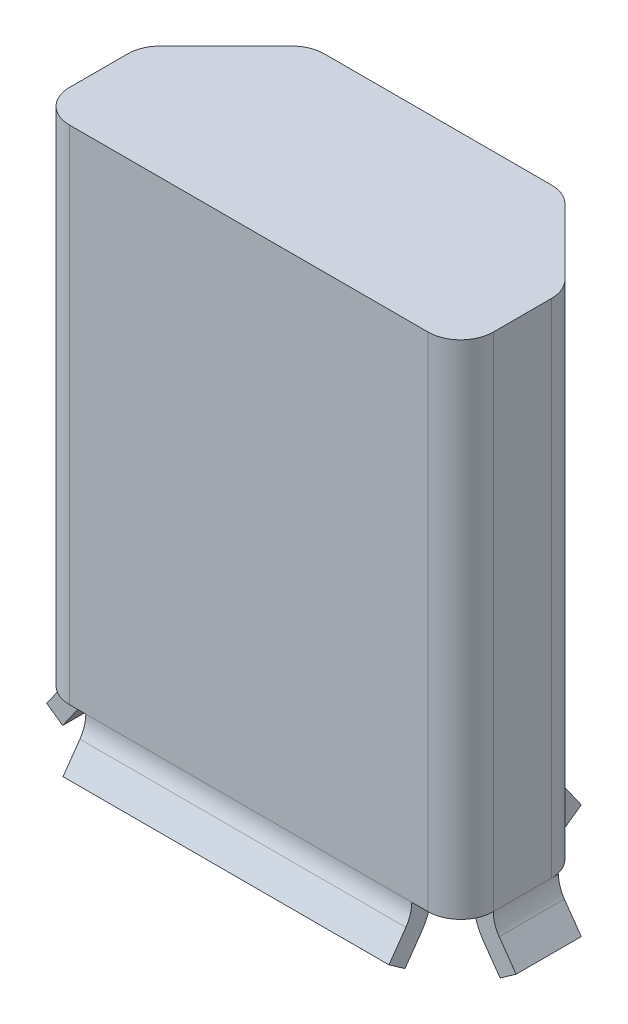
ISO-10303-21;
HEADER;
FILE_DESCRIPTION(('STEP AP214'),'2;1');
FILE_NAME('part.step','',(''),(''),'','','');
FILE_SCHEMA(('AUTOMOTIVE_DESIGN { 1 0 10303 214 1 1 1 1 }'));
ENDSEC;
DATA;
#1=APPLICATION_CONTEXT('core data for automotive mechanical design processes');
#2=APPLICATION_PROTOCOL_DEFINITION('international standard','automotive_design',2000,#1);
#3=PRODUCT_CONTEXT('',#1,'mechanical');
#4=PRODUCT('Part','Part','',(#3));
#5=PRODUCT_RELATED_PRODUCT_CATEGORY('part','',(#4));
#6=PRODUCT_DEFINITION_FORMATION('','',#4);
#7=PRODUCT_DEFINITION_CONTEXT('part definition',#1,'design');
#8=PRODUCT_DEFINITION('design','',#6,#7);
#9=PRODUCT_DEFINITION_SHAPE('','',#8);
#10=(LENGTH_UNIT() NAMED_UNIT(*) SI_UNIT(.MILLI.,.METRE.));
#11=(NAMED_UNIT(*) PLANE_ANGLE_UNIT() SI_UNIT($,.RADIAN.));
#12=(NAMED_UNIT(*) SI_UNIT($,.STERADIAN.) SOLID_ANGLE_UNIT());
#13=UNCERTAINTY_MEASURE_WITH_UNIT(LENGTH_MEASURE(1.E-05),#10,'distance_accuracy_value','');
#14=(GEOMETRIC_REPRESENTATION_CONTEXT(3) GLOBAL_UNCERTAINTY_ASSIGNED_CONTEXT((#13)) GLOBAL_UNIT_ASSIGNED_CONTEXT((#10,
#11,#12)) REPRESENTATION_CONTEXT('',''));
#15=CARTESIAN_POINT('',(0.,0.,0.));
#16=DIRECTION('',(0.,0.,1.));
#17=DIRECTION('',(1.,0.,0.));
#18=AXIS2_PLACEMENT_3D('',#15,#16,#17);
#19=CARTESIAN_POINT('',(-3.25,-7.7,2.90000000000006));
#20=DIRECTION('',(0.,1.,0.));
#21=DIRECTION('',(0.,0.,-1.));
#22=AXIS2_PLACEMENT_3D('',#19,#20,#21);
#23=PLANE('',#22);
#24=DIRECTION('',(0.,0.,-1.));
#25=VECTOR('',#24,1.);
#26=CARTESIAN_POINT('',(2.95,-7.7,2.40000000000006));
#27=LINE('',#26,#25);
#28=CARTESIAN_POINT('',(2.95,-7.7,1.50710678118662));
#29=VERTEX_POINT('',#28);
#30=CARTESIAN_POINT('',(2.95,-7.7,1.40000000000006));
#31=VERTEX_POINT('',#30);
#32=EDGE_CURVE('E340',#29,#31,#27,.T.);
#33=ORIENTED_EDGE('',*,*,#32,.F.);
#34=CARTESIAN_POINT('',(2.75,-7.7,1.50710678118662));
#35=DIRECTION('',(0.,-1.,0.));
#36=DIRECTION('',(0.,0.,-1.));
#37=AXIS2_PLACEMENT_3D('',#34,#35,#36);
#38=CIRCLE('',#37,0.2);
#39=CARTESIAN_POINT('',(2.89142135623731,-7.7,1.3656854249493));
#40=VERTEX_POINT('',#39);
#41=EDGE_CURVE('E651',#40,#29,#38,.T.);
#42=ORIENTED_EDGE('',*,*,#41,.F.);
#43=DIRECTION('',(0.707106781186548,0.,0.707106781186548));
#44=VECTOR('',#43,1.);
#45=CARTESIAN_POINT('',(1.88431457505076,-7.7,0.358578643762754));
#46=LINE('',#45,#44);
#47=CARTESIAN_POINT('',(1.88431457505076,-7.7,0.358578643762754));
#48=VERTEX_POINT('',#47);
#49=EDGE_CURVE('E526',#48,#40,#46,.T.);
#50=ORIENTED_EDGE('',*,*,#49,.F.);
#51=CARTESIAN_POINT('',(1.74289321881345,-7.7,0.500000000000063));
#52=DIRECTION('',(0.,-1.,0.));
#53=DIRECTION('',(0.,0.,-1.));
#54=AXIS2_PLACEMENT_3D('',#51,#52,#53);
#55=CIRCLE('',#54,0.2);
#56=CARTESIAN_POINT('',(1.74289321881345,-7.7,0.300000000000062));
#57=VERTEX_POINT('',#56);
#58=EDGE_CURVE('E605',#57,#48,#55,.T.);
#59=ORIENTED_EDGE('',*,*,#58,.F.);
#60=DIRECTION('',(-1.,0.,0.));
#61=VECTOR('',#60,1.);
#62=CARTESIAN_POINT('',(1.85,-7.7,0.300000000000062));
#63=LINE('',#62,#61);
#64=CARTESIAN_POINT('',(1.85,-7.7,0.300000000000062));
#65=VERTEX_POINT('',#64);
#66=EDGE_CURVE('E551',#65,#57,#63,.T.);
#67=ORIENTED_EDGE('',*,*,#66,.F.);
#68=DIRECTION('',(0.,0.,-1.));
#69=VECTOR('',#68,1.);
#70=CARTESIAN_POINT('',(1.85,-7.7,0.300000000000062));
#71=LINE('',#70,#69);
#72=CARTESIAN_POINT('',(1.85,-7.7,0.0116065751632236));
#73=VERTEX_POINT('',#72);
#74=EDGE_CURVE('E539',#65,#73,#71,.T.);
#75=ORIENTED_EDGE('',*,*,#74,.T.);
#76=CARTESIAN_POINT('',(1.74289321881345,-7.7,0.500000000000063));
#77=DIRECTION('',(0.,-1.,0.));
#78=DIRECTION('',(-1.,0.,0.));
#79=AXIS2_PLACEMENT_3D('',#76,#77,#78);
#80=CIRCLE('',#79,0.5);
#81=CARTESIAN_POINT('',(2.09644660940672,-7.7,0.146446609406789));
#82=VERTEX_POINT('',#81);
#83=EDGE_CURVE('E253',#73,#82,#80,.T.);
#84=ORIENTED_EDGE('',*,*,#83,.T.);
#85=DIRECTION('',(-0.707106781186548,0.,-0.707106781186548));
#86=VECTOR('',#85,1.);
#87=CARTESIAN_POINT('',(1.95,-7.7,0.));
#88=LINE('',#87,#86);
#89=CARTESIAN_POINT('',(3.10355339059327,-7.7,1.15355339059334));
#90=VERTEX_POINT('',#89);
#91=EDGE_CURVE('E41',#90,#82,#88,.T.);
#92=ORIENTED_EDGE('',*,*,#91,.F.);
#93=CARTESIAN_POINT('',(2.75,-7.7,1.50710678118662));
#94=DIRECTION('',(0.,-1.,0.));
#95=DIRECTION('',(-1.,0.,0.));
#96=AXIS2_PLACEMENT_3D('',#93,#94,#95);
#97=CIRCLE('',#96,0.5);
#98=CARTESIAN_POINT('',(3.23839342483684,-7.7,1.40000000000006));
#99=VERTEX_POINT('',#98);
#100=EDGE_CURVE('E584',#90,#99,#97,.T.);
#101=ORIENTED_EDGE('',*,*,#100,.T.);
#102=DIRECTION('',(-1.,0.,0.));
#103=VECTOR('',#102,1.);
#104=CARTESIAN_POINT('',(3.25,-7.7,1.40000000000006));
#105=LINE('',#104,#103);
#106=EDGE_CURVE('E873',#99,#31,#105,.T.);
#107=ORIENTED_EDGE('',*,*,#106,.T.);
#108=EDGE_LOOP('',(#33,#42,#50,#59,#67,#75,#84,#92,#101,#107));
#109=FACE_BOUND('',#108,.T.);
#110=ADVANCED_FACE('F17',(#109),#23,.F.);
#111=CARTESIAN_POINT('',(-3.25,-7.7,2.90000000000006));
#112=DIRECTION('',(0.,1.,0.));
#113=DIRECTION('',(0.,0.,-1.));
#114=AXIS2_PLACEMENT_3D('',#111,#112,#113);
#115=PLANE('',#114);
#116=CARTESIAN_POINT('',(-2.75,-7.7,2.40000000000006));
#117=DIRECTION('',(0.,-1.,0.));
#118=DIRECTION('',(-1.,0.,0.));
#119=AXIS2_PLACEMENT_3D('',#116,#117,#118);
#120=CIRCLE('',#119,0.5);
#121=CARTESIAN_POINT('',(-2.75,-7.7,2.90000000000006));
#122=VERTEX_POINT('',#121);
#123=CARTESIAN_POINT('',(-3.25,-7.7,2.40000000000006));
#124=VERTEX_POINT('',#123);
#125=EDGE_CURVE('E585',#122,#124,#120,.T.);
#126=ORIENTED_EDGE('',*,*,#125,.T.);
#127=DIRECTION('',(1.,0.,0.));
#128=VECTOR('',#127,1.);
#129=CARTESIAN_POINT('',(-3.25,-7.7,2.40000000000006));
#130=LINE('',#129,#128);
#131=CARTESIAN_POINT('',(-2.95,-7.7,2.40000000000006));
#132=VERTEX_POINT('',#131);
#133=EDGE_CURVE('E336',#124,#132,#130,.T.);
#134=ORIENTED_EDGE('',*,*,#133,.T.);
#135=CARTESIAN_POINT('',(-2.75,-7.7,2.40000000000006));
#136=DIRECTION('',(0.,-1.,0.));
#137=DIRECTION('',(0.,0.,-1.));
#138=AXIS2_PLACEMENT_3D('',#135,#136,#137);
#139=CIRCLE('',#138,0.2);
#140=CARTESIAN_POINT('',(-2.75,-7.7,2.60000000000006));
#141=VERTEX_POINT('',#140);
#142=EDGE_CURVE('E447',#141,#132,#139,.T.);
#143=ORIENTED_EDGE('',*,*,#142,.F.);
#144=DIRECTION('',(-1.,0.,0.));
#145=VECTOR('',#144,1.);
#146=CARTESIAN_POINT('',(2.75,-7.7,2.60000000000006));
#147=LINE('',#146,#145);
#148=CARTESIAN_POINT('',(-2.5,-7.7,2.60000000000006));
#149=VERTEX_POINT('',#148);
#150=EDGE_CURVE('E448',#149,#141,#147,.T.);
#151=ORIENTED_EDGE('',*,*,#150,.F.);
#152=DIRECTION('',(0.,0.,-1.));
#153=VECTOR('',#152,1.);
#154=CARTESIAN_POINT('',(-2.5,-7.7,2.90000000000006));
#155=LINE('',#154,#153);
#156=CARTESIAN_POINT('',(-2.5,-7.7,2.90000000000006));
#157=VERTEX_POINT('',#156);
#158=EDGE_CURVE('E387',#157,#149,#155,.T.);
#159=ORIENTED_EDGE('',*,*,#158,.F.);
#160=DIRECTION('',(1.,0.,0.));
#161=VECTOR('',#160,1.);
#162=CARTESIAN_POINT('',(-3.25,-7.7,2.90000000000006));
#163=LINE('',#162,#161);
#164=EDGE_CURVE('E268',#122,#157,#163,.T.);
#165=ORIENTED_EDGE('',*,*,#164,.F.);
#166=EDGE_LOOP('',(#126,#134,#143,#151,#159,#165));
#167=FACE_BOUND('',#166,.T.);
#168=ADVANCED_FACE('F1151',(#167),#115,.F.);
#169=CARTESIAN_POINT('',(-3.25,-7.7,2.90000000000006));
#170=DIRECTION('',(0.,1.,0.));
#171=DIRECTION('',(0.,0.,-1.));
#172=AXIS2_PLACEMENT_3D('',#169,#170,#171);
#173=PLANE('',#172);
#174=CARTESIAN_POINT('',(2.75,-7.7,2.40000000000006));
#175=DIRECTION('',(0.,-1.,0.));
#176=DIRECTION('',(0.,0.,-1.));
#177=AXIS2_PLACEMENT_3D('',#174,#175,#176);
#178=CIRCLE('',#177,0.2);
#179=CARTESIAN_POINT('',(2.95,-7.7,2.40000000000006));
#180=VERTEX_POINT('',#179);
#181=CARTESIAN_POINT('',(2.75,-7.7,2.60000000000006));
#182=VERTEX_POINT('',#181);
#183=EDGE_CURVE('E438',#180,#182,#178,.T.);
#184=ORIENTED_EDGE('',*,*,#183,.F.);
#185=DIRECTION('',(-1.,0.,0.));
#186=VECTOR('',#185,1.);
#187=CARTESIAN_POINT('',(3.25,-7.7,2.40000000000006));
#188=LINE('',#187,#186);
#189=CARTESIAN_POINT('',(3.25,-7.7,2.40000000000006));
#190=VERTEX_POINT('',#189);
#191=EDGE_CURVE('E306',#190,#180,#188,.T.);
#192=ORIENTED_EDGE('',*,*,#191,.F.);
#193=CARTESIAN_POINT('',(2.75,-7.7,2.40000000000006));
#194=DIRECTION('',(0.,-1.,0.));
#195=DIRECTION('',(-1.,0.,0.));
#196=AXIS2_PLACEMENT_3D('',#193,#194,#195);
#197=CIRCLE('',#196,0.5);
#198=CARTESIAN_POINT('',(2.75,-7.7,2.90000000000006));
#199=VERTEX_POINT('',#198);
#200=EDGE_CURVE('E296',#190,#199,#197,.T.);
#201=ORIENTED_EDGE('',*,*,#200,.T.);
#202=DIRECTION('',(1.,0.,0.));
#203=VECTOR('',#202,1.);
#204=CARTESIAN_POINT('',(-3.25,-7.7,2.90000000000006));
#205=LINE('',#204,#203);
#206=CARTESIAN_POINT('',(2.5,-7.7,2.90000000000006));
#207=VERTEX_POINT('',#206);
#208=EDGE_CURVE('E219',#207,#199,#205,.T.);
#209=ORIENTED_EDGE('',*,*,#208,.F.);
#210=DIRECTION('',(0.,0.,-1.));
#211=VECTOR('',#210,1.);
#212=CARTESIAN_POINT('',(2.5,-7.7,2.90000000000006));
#213=LINE('',#212,#211);
#214=CARTESIAN_POINT('',(2.5,-7.7,2.60000000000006));
#215=VERTEX_POINT('',#214);
#216=EDGE_CURVE('E404',#207,#215,#213,.T.);
#217=ORIENTED_EDGE('',*,*,#216,.T.);
#218=DIRECTION('',(-1.,0.,0.));
#219=VECTOR('',#218,1.);
#220=CARTESIAN_POINT('',(2.75,-7.7,2.60000000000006));
#221=LINE('',#220,#219);
#222=EDGE_CURVE('E568',#182,#215,#221,.T.);
#223=ORIENTED_EDGE('',*,*,#222,.F.);
#224=EDGE_LOOP('',(#184,#192,#201,#209,#217,#223));
#225=FACE_BOUND('',#224,.T.);
#226=ADVANCED_FACE('F19',(#225),#173,.F.);
#227=CARTESIAN_POINT('',(-3.25,-7.7,2.90000000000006));
#228=DIRECTION('',(0.,1.,0.));
#229=DIRECTION('',(0.,0.,-1.));
#230=AXIS2_PLACEMENT_3D('',#227,#228,#229);
#231=PLANE('',#230);
#232=CARTESIAN_POINT('',(-2.75,-7.7,1.50710678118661));
#233=DIRECTION('',(0.,-1.,0.));
#234=DIRECTION('',(0.,0.,-1.));
#235=AXIS2_PLACEMENT_3D('',#232,#233,#234);
#236=CIRCLE('',#235,0.2);
#237=CARTESIAN_POINT('',(-2.95,-7.7,1.50710678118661));
#238=VERTEX_POINT('',#237);
#239=CARTESIAN_POINT('',(-2.89142135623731,-7.7,1.3656854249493));
#240=VERTEX_POINT('',#239);
#241=EDGE_CURVE('E360',#238,#240,#236,.T.);
#242=ORIENTED_EDGE('',*,*,#241,.F.);
#243=DIRECTION('',(0.,0.,-1.));
#244=VECTOR('',#243,1.);
#245=CARTESIAN_POINT('',(-2.95,-7.7,2.40000000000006));
#246=LINE('',#245,#244);
#247=CARTESIAN_POINT('',(-2.95,-7.7,1.40000000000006));
#248=VERTEX_POINT('',#247);
#249=EDGE_CURVE('E473',#238,#248,#246,.T.);
#250=ORIENTED_EDGE('',*,*,#249,.T.);
#251=DIRECTION('',(1.,0.,0.));
#252=VECTOR('',#251,1.);
#253=CARTESIAN_POINT('',(-3.25,-7.7,1.40000000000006));
#254=LINE('',#253,#252);
#255=CARTESIAN_POINT('',(-3.23839342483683,-7.7,1.40000000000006));
#256=VERTEX_POINT('',#255);
#257=EDGE_CURVE('E395',#256,#248,#254,.T.);
#258=ORIENTED_EDGE('',*,*,#257,.F.);
#259=CARTESIAN_POINT('',(-2.75,-7.7,1.50710678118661));
#260=DIRECTION('',(0.,-1.,0.));
#261=DIRECTION('',(-1.,0.,0.));
#262=AXIS2_PLACEMENT_3D('',#259,#260,#261);
#263=CIRCLE('',#262,0.5);
#264=CARTESIAN_POINT('',(-3.10355339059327,-7.7,1.15355339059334));
#265=VERTEX_POINT('',#264);
#266=EDGE_CURVE('E749',#256,#265,#263,.T.);
#267=ORIENTED_EDGE('',*,*,#266,.T.);
#268=DIRECTION('',(-0.707106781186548,0.,0.707106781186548));
#269=VECTOR('',#268,1.);
#270=CARTESIAN_POINT('',(-1.95,-7.7,0.));
#271=LINE('',#270,#269);
#272=CARTESIAN_POINT('',(-2.09644660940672,-7.7,0.146446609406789));
#273=VERTEX_POINT('',#272);
#274=EDGE_CURVE('E264',#273,#265,#271,.T.);
#275=ORIENTED_EDGE('',*,*,#274,.F.);
#276=CARTESIAN_POINT('',(-1.74289321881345,-7.7,0.500000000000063));
#277=DIRECTION('',(0.,-1.,0.));
#278=DIRECTION('',(-1.,0.,0.));
#279=AXIS2_PLACEMENT_3D('',#276,#277,#278);
#280=CIRCLE('',#279,0.5);
#281=CARTESIAN_POINT('',(-1.85,-7.7,0.0116065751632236));
#282=VERTEX_POINT('',#281);
#283=EDGE_CURVE('E242',#273,#282,#280,.T.);
#284=ORIENTED_EDGE('',*,*,#283,.T.);
#285=DIRECTION('',(0.,0.,-1.));
#286=VECTOR('',#285,1.);
#287=CARTESIAN_POINT('',(-1.85,-7.7,0.300000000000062));
#288=LINE('',#287,#286);
#289=CARTESIAN_POINT('',(-1.85,-7.7,0.300000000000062));
#290=VERTEX_POINT('',#289);
#291=EDGE_CURVE('E456',#290,#282,#288,.T.);
#292=ORIENTED_EDGE('',*,*,#291,.F.);
#293=DIRECTION('',(-1.,0.,0.));
#294=VECTOR('',#293,1.);
#295=CARTESIAN_POINT('',(1.85,-7.7,0.300000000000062));
#296=LINE('',#295,#294);
#297=CARTESIAN_POINT('',(-1.74289321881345,-7.7,0.300000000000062));
#298=VERTEX_POINT('',#297);
#299=EDGE_CURVE('E564',#298,#290,#296,.T.);
#300=ORIENTED_EDGE('',*,*,#299,.F.);
#301=CARTESIAN_POINT('',(-1.74289321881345,-7.7,0.500000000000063));
#302=DIRECTION('',(0.,-1.,0.));
#303=DIRECTION('',(0.,0.,-1.));
#304=AXIS2_PLACEMENT_3D('',#301,#302,#303);
#305=CIRCLE('',#304,0.2);
#306=CARTESIAN_POINT('',(-1.88431457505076,-7.7,0.358578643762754));
#307=VERTEX_POINT('',#306);
#308=EDGE_CURVE('E310',#307,#298,#305,.T.);
#309=ORIENTED_EDGE('',*,*,#308,.F.);
#310=DIRECTION('',(0.707106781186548,0.,-0.707106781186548));
#311=VECTOR('',#310,1.);
#312=CARTESIAN_POINT('',(-2.89142135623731,-7.7,1.3656854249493));
#313=LINE('',#312,#311);
#314=EDGE_CURVE('E633',#240,#307,#313,.T.);
#315=ORIENTED_EDGE('',*,*,#314,.F.);
#316=EDGE_LOOP('',(#242,#250,#258,#267,#275,#284,#292,#300,#309,#315));
#317=FACE_BOUND('',#316,.T.);
#318=ADVANCED_FACE('F760',(#317),#231,.F.);
#319=CARTESIAN_POINT('',(3.25,0.,2.9));
#320=DIRECTION('',(-1.,0.,0.));
#321=DIRECTION('',(0.,1.,0.));
#322=AXIS2_PLACEMENT_3D('',#319,#320,#321);
#323=PLANE('',#322);
#324=DIRECTION('',(0.,0.,-1.));
#325=VECTOR('',#324,1.);
#326=CARTESIAN_POINT('',(3.25,-7.7,2.90000000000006));
#327=LINE('',#326,#325);
#328=CARTESIAN_POINT('',(3.25,-7.7,1.50710678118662));
#329=VERTEX_POINT('',#328);
#330=EDGE_CURVE('E352',#190,#329,#327,.T.);
#331=ORIENTED_EDGE('',*,*,#330,.T.);
#332=DIRECTION('',(0.,1.,0.));
#333=VECTOR('',#332,1.);
#334=CARTESIAN_POINT('',(3.25,0.,1.50710678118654));
#335=LINE('',#334,#333);
#336=CARTESIAN_POINT('',(3.25,0.,1.50710678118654));
#337=VERTEX_POINT('',#336);
#338=EDGE_CURVE('E739',#329,#337,#335,.T.);
#339=ORIENTED_EDGE('',*,*,#338,.T.);
#340=DIRECTION('',(0.,0.,-1.));
#341=VECTOR('',#340,1.);
#342=CARTESIAN_POINT('',(3.25,0.,2.9));
#343=LINE('',#342,#341);
#344=CARTESIAN_POINT('',(3.25,0.,2.4));
#345=VERTEX_POINT('',#344);
#346=EDGE_CURVE('E11',#345,#337,#343,.T.);
#347=ORIENTED_EDGE('',*,*,#346,.F.);
#348=DIRECTION('',(0.,-1.,0.));
#349=VECTOR('',#348,1.);
#350=CARTESIAN_POINT('',(3.25,-7.7,2.40000000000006));
#351=LINE('',#350,#349);
#352=EDGE_CURVE('E309',#345,#190,#351,.T.);
#353=ORIENTED_EDGE('',*,*,#352,.T.);
#354=EDGE_LOOP('',(#331,#339,#347,#353));
#355=FACE_BOUND('',#354,.T.);
#356=ADVANCED_FACE('F1138',(#355),#323,.F.);
#357=CARTESIAN_POINT('',(-3.25,0.,2.9));
#358=DIRECTION('',(0.,-1.,0.));
#359=DIRECTION('',(-1.,0.,0.));
#360=AXIS2_PLACEMENT_3D('',#357,#358,#359);
#361=PLANE('',#360);
#362=DIRECTION('',(-0.707106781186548,0.,-0.707106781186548));
#363=VECTOR('',#362,1.);
#364=CARTESIAN_POINT('',(1.95,0.,0.));
#365=LINE('',#364,#363);
#366=CARTESIAN_POINT('',(3.10355339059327,0.,1.15355339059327));
#367=VERTEX_POINT('',#366);
#368=CARTESIAN_POINT('',(2.09644660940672,0.,0.146446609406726));
#369=VERTEX_POINT('',#368);
#370=EDGE_CURVE('E258',#367,#369,#365,.T.);
#371=ORIENTED_EDGE('',*,*,#370,.T.);
#372=CARTESIAN_POINT('',(1.74289321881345,0.,0.5));
#373=DIRECTION('',(0.,1.,0.));
#374=DIRECTION('',(1.,0.,0.));
#375=AXIS2_PLACEMENT_3D('',#372,#373,#374);
#376=CIRCLE('',#375,0.5);
#377=CARTESIAN_POINT('',(1.74289321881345,0.,0.));
#378=VERTEX_POINT('',#377);
#379=EDGE_CURVE('E214',#369,#378,#376,.T.);
#380=ORIENTED_EDGE('',*,*,#379,.T.);
#381=DIRECTION('',(-1.,0.,0.));
#382=VECTOR('',#381,1.);
#383=CARTESIAN_POINT('',(-3.25,0.,0.));
#384=LINE('',#383,#382);
#385=CARTESIAN_POINT('',(-1.74289321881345,0.,0.));
#386=VERTEX_POINT('',#385);
#387=EDGE_CURVE('E207',#378,#386,#384,.T.);
#388=ORIENTED_EDGE('',*,*,#387,.T.);
#389=CARTESIAN_POINT('',(-1.74289321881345,0.,0.5));
#390=DIRECTION('',(0.,1.,0.));
#391=DIRECTION('',(1.,0.,0.));
#392=AXIS2_PLACEMENT_3D('',#389,#390,#391);
#393=CIRCLE('',#392,0.5);
#394=CARTESIAN_POINT('',(-2.09644660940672,0.,0.146446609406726));
#395=VERTEX_POINT('',#394);
#396=EDGE_CURVE('E211',#386,#395,#393,.T.);
#397=ORIENTED_EDGE('',*,*,#396,.T.);
#398=DIRECTION('',(-0.707106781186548,0.,0.707106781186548));
#399=VECTOR('',#398,1.);
#400=CARTESIAN_POINT('',(-1.95,0.,0.));
#401=LINE('',#400,#399);
#402=CARTESIAN_POINT('',(-3.10355339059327,0.,1.15355339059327));
#403=VERTEX_POINT('',#402);
#404=EDGE_CURVE('E261',#395,#403,#401,.T.);
#405=ORIENTED_EDGE('',*,*,#404,.T.);
#406=CARTESIAN_POINT('',(-2.75,0.,1.50710678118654));
#407=DIRECTION('',(0.,1.,0.));
#408=DIRECTION('',(1.,0.,0.));
#409=AXIS2_PLACEMENT_3D('',#406,#407,#408);
#410=CIRCLE('',#409,0.5);
#411=CARTESIAN_POINT('',(-3.25,0.,1.50710678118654));
#412=VERTEX_POINT('',#411);
#413=EDGE_CURVE('E370',#403,#412,#410,.T.);
#414=ORIENTED_EDGE('',*,*,#413,.T.);
#415=DIRECTION('',(0.,0.,-1.));
#416=VECTOR('',#415,1.);
#417=CARTESIAN_POINT('',(-3.25,0.,2.9));
#418=LINE('',#417,#416);
#419=CARTESIAN_POINT('',(-3.25,0.,2.4));
#420=VERTEX_POINT('',#419);
#421=EDGE_CURVE('E21',#420,#412,#418,.T.);
#422=ORIENTED_EDGE('',*,*,#421,.F.);
#423=CARTESIAN_POINT('',(-2.75,0.,2.4));
#424=DIRECTION('',(0.,1.,0.));
#425=DIRECTION('',(1.,0.,0.));
#426=AXIS2_PLACEMENT_3D('',#423,#424,#425);
#427=CIRCLE('',#426,0.5);
#428=CARTESIAN_POINT('',(-2.75,0.,2.9));
#429=VERTEX_POINT('',#428);
#430=EDGE_CURVE('E301',#420,#429,#427,.T.);
#431=ORIENTED_EDGE('',*,*,#430,.T.);
#432=DIRECTION('',(-1.,0.,0.));
#433=VECTOR('',#432,1.);
#434=CARTESIAN_POINT('',(-3.25,0.,2.9));
#435=LINE('',#434,#433);
#436=CARTESIAN_POINT('',(2.75,0.,2.9));
#437=VERTEX_POINT('',#436);
#438=EDGE_CURVE('E267',#437,#429,#435,.T.);
#439=ORIENTED_EDGE('',*,*,#438,.F.);
#440=CARTESIAN_POINT('',(2.75,0.,2.4));
#441=DIRECTION('',(0.,1.,0.));
#442=DIRECTION('',(1.,0.,0.));
#443=AXIS2_PLACEMENT_3D('',#440,#441,#442);
#444=CIRCLE('',#443,0.5);
#445=EDGE_CURVE('E299',#437,#345,#444,.T.);
#446=ORIENTED_EDGE('',*,*,#445,.T.);
#447=ORIENTED_EDGE('',*,*,#346,.T.);
#448=CARTESIAN_POINT('',(2.75,0.,1.50710678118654));
#449=DIRECTION('',(0.,1.,0.));
#450=DIRECTION('',(1.,0.,0.));
#451=AXIS2_PLACEMENT_3D('',#448,#449,#450);
#452=CIRCLE('',#451,0.5);
#453=EDGE_CURVE('E735',#337,#367,#452,.T.);
#454=ORIENTED_EDGE('',*,*,#453,.T.);
#455=EDGE_LOOP('',(#371,#380,#388,#397,#405,#414,#422,#431,#439,#446,#447,#454));
#456=FACE_BOUND('',#455,.T.);
#457=ADVANCED_FACE('F209',(#456),#361,.F.);
#458=CARTESIAN_POINT('',(-3.25,-7.7,2.90000000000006));
#459=DIRECTION('',(1.,0.,0.));
#460=DIRECTION('',(0.,1.,0.));
#461=AXIS2_PLACEMENT_3D('',#458,#459,#460);
#462=PLANE('',#461);
#463=ORIENTED_EDGE('',*,*,#421,.T.);
#464=DIRECTION('',(0.,-1.,0.));
#465=VECTOR('',#464,1.);
#466=CARTESIAN_POINT('',(-3.25,-7.7,1.50710678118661));
#467=LINE('',#466,#465);
#468=CARTESIAN_POINT('',(-3.25,-7.7,1.50710678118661));
#469=VERTEX_POINT('',#468);
#470=EDGE_CURVE('E375',#412,#469,#467,.T.);
#471=ORIENTED_EDGE('',*,*,#470,.T.);
#472=DIRECTION('',(0.,0.,-1.));
#473=VECTOR('',#472,1.);
#474=CARTESIAN_POINT('',(-3.25,-7.7,2.90000000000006));
#475=LINE('',#474,#473);
#476=EDGE_CURVE('E461',#124,#469,#475,.T.);
#477=ORIENTED_EDGE('',*,*,#476,.F.);
#478=DIRECTION('',(0.,1.,0.));
#479=VECTOR('',#478,1.);
#480=CARTESIAN_POINT('',(-3.25,0.,2.4));
#481=LINE('',#480,#479);
#482=EDGE_CURVE('E683',#124,#420,#481,.T.);
#483=ORIENTED_EDGE('',*,*,#482,.T.);
#484=EDGE_LOOP('',(#463,#471,#477,#483));
#485=FACE_BOUND('',#484,.T.);
#486=ADVANCED_FACE('F1144',(#485),#462,.F.);
#487=CARTESIAN_POINT('',(0.,0.,0.));
#488=DIRECTION('',(0.,0.,1.));
#489=DIRECTION('',(0.,-1.,0.));
#490=AXIS2_PLACEMENT_3D('',#487,#488,#489);
#491=PLANE('',#490);
#492=ORIENTED_EDGE('',*,*,#387,.F.);
#493=DIRECTION('',(0.,-1.,0.));
#494=VECTOR('',#493,1.);
#495=CARTESIAN_POINT('',(1.74289321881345,-7.7,0.));
#496=LINE('',#495,#494);
#497=CARTESIAN_POINT('',(1.74289321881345,-7.7,0.));
#498=VERTEX_POINT('',#497);
#499=EDGE_CURVE('E231',#378,#498,#496,.T.);
#500=ORIENTED_EDGE('',*,*,#499,.T.);
#501=DIRECTION('',(1.,0.,0.));
#502=VECTOR('',#501,1.);
#503=CARTESIAN_POINT('',(-3.25,-7.7,0.));
#504=LINE('',#503,#502);
#505=CARTESIAN_POINT('',(-1.74289321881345,-7.7,0.));
#506=VERTEX_POINT('',#505);
#507=EDGE_CURVE('E226',#506,#498,#504,.T.);
#508=ORIENTED_EDGE('',*,*,#507,.F.);
#509=DIRECTION('',(0.,1.,0.));
#510=VECTOR('',#509,1.);
#511=CARTESIAN_POINT('',(-1.74289321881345,0.,0.));
#512=LINE('',#511,#510);
#513=EDGE_CURVE('E222',#506,#386,#512,.T.);
#514=ORIENTED_EDGE('',*,*,#513,.T.);
#515=EDGE_LOOP('',(#492,#500,#508,#514));
#516=FACE_BOUND('',#515,.T.);
#517=ADVANCED_FACE('F223',(#516),#491,.F.);
#518=CARTESIAN_POINT('',(0.,0.,2.9));
#519=DIRECTION('',(0.,0.,1.));
#520=DIRECTION('',(0.,-1.,0.));
#521=AXIS2_PLACEMENT_3D('',#518,#519,#520);
#522=PLANE('',#521);
#523=ORIENTED_EDGE('',*,*,#438,.T.);
#524=DIRECTION('',(0.,-1.,0.));
#525=VECTOR('',#524,1.);
#526=CARTESIAN_POINT('',(-2.75,-7.7,2.90000000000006));
#527=LINE('',#526,#525);
#528=EDGE_CURVE('E580',#429,#122,#527,.T.);
#529=ORIENTED_EDGE('',*,*,#528,.T.);
#530=ORIENTED_EDGE('',*,*,#164,.T.);
#531=DIRECTION('',(-1.,0.,0.));
#532=VECTOR('',#531,1.);
#533=CARTESIAN_POINT('',(2.5,-7.7,2.90000000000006));
#534=LINE('',#533,#532);
#535=EDGE_CURVE('E284',#207,#157,#534,.T.);
#536=ORIENTED_EDGE('',*,*,#535,.F.);
#537=ORIENTED_EDGE('',*,*,#208,.T.);
#538=DIRECTION('',(0.,1.,0.));
#539=VECTOR('',#538,1.);
#540=CARTESIAN_POINT('',(2.75,0.,2.9));
#541=LINE('',#540,#539);
#542=EDGE_CURVE('E281',#199,#437,#541,.T.);
#543=ORIENTED_EDGE('',*,*,#542,.T.);
#544=EDGE_LOOP('',(#523,#529,#530,#536,#537,#543));
#545=FACE_BOUND('',#544,.T.);
#546=ADVANCED_FACE('F280',(#545),#522,.T.);
#547=CARTESIAN_POINT('',(-1.95,-7.7,0.));
#548=DIRECTION('',(-0.707106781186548,0.,-0.707106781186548));
#549=DIRECTION('',(-0.707106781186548,0.,0.707106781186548));
#550=AXIS2_PLACEMENT_3D('',#547,#548,#549);
#551=PLANE('',#550);
#552=ORIENTED_EDGE('',*,*,#404,.F.);
#553=DIRECTION('',(0.,-1.,0.));
#554=VECTOR('',#553,1.);
#555=CARTESIAN_POINT('',(-2.09644660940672,-7.7,0.146446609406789));
#556=LINE('',#555,#554);
#557=EDGE_CURVE('E236',#395,#273,#556,.T.);
#558=ORIENTED_EDGE('',*,*,#557,.T.);
#559=ORIENTED_EDGE('',*,*,#274,.T.);
#560=DIRECTION('',(0.,1.,0.));
#561=VECTOR('',#560,1.);
#562=CARTESIAN_POINT('',(-3.10355339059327,0.,1.15355339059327));
#563=LINE('',#562,#561);
#564=EDGE_CURVE('E374',#265,#403,#563,.T.);
#565=ORIENTED_EDGE('',*,*,#564,.T.);
#566=EDGE_LOOP('',(#552,#558,#559,#565));
#567=FACE_BOUND('',#566,.T.);
#568=ADVANCED_FACE('F1226',(#567),#551,.T.);
#569=CARTESIAN_POINT('',(1.95,-7.7,0.));
#570=DIRECTION('',(0.707106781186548,0.,-0.707106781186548));
#571=DIRECTION('',(0.,-1.,0.));
#572=AXIS2_PLACEMENT_3D('',#569,#570,#571);
#573=PLANE('',#572);
#574=ORIENTED_EDGE('',*,*,#91,.T.);
#575=DIRECTION('',(0.,1.,0.));
#576=VECTOR('',#575,1.);
#577=CARTESIAN_POINT('',(2.09644660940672,0.,0.146446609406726));
#578=LINE('',#577,#576);
#579=EDGE_CURVE('E250',#82,#369,#578,.T.);
#580=ORIENTED_EDGE('',*,*,#579,.T.);
#581=ORIENTED_EDGE('',*,*,#370,.F.);
#582=DIRECTION('',(0.,-1.,0.));
#583=VECTOR('',#582,1.);
#584=CARTESIAN_POINT('',(3.10355339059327,-7.7,1.15355339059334));
#585=LINE('',#584,#583);
#586=EDGE_CURVE('E732',#367,#90,#585,.T.);
#587=ORIENTED_EDGE('',*,*,#586,.T.);
#588=EDGE_LOOP('',(#574,#580,#581,#587));
#589=FACE_BOUND('',#588,.T.);
#590=ADVANCED_FACE('F1222',(#589),#573,.T.);
#591=CARTESIAN_POINT('',(1.74289321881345,-7.7,0.500000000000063));
#592=DIRECTION('',(0.,-1.,0.));
#593=DIRECTION('',(0.,0.,-1.));
#594=AXIS2_PLACEMENT_3D('',#591,#592,#593);
#595=CYLINDRICAL_SURFACE('',#594,0.5);
#596=CARTESIAN_POINT('',(1.74289321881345,-7.7,0.500000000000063));
#597=DIRECTION('',(0.,-1.,0.));
#598=DIRECTION('',(-1.,0.,0.));
#599=AXIS2_PLACEMENT_3D('',#596,#597,#598);
#600=CIRCLE('',#599,0.5);
#601=EDGE_CURVE('E351',#498,#73,#600,.T.);
#602=ORIENTED_EDGE('',*,*,#601,.F.);
#603=ORIENTED_EDGE('',*,*,#499,.F.);
#604=ORIENTED_EDGE('',*,*,#379,.F.);
#605=ORIENTED_EDGE('',*,*,#579,.F.);
#606=ORIENTED_EDGE('',*,*,#83,.F.);
#607=EDGE_LOOP('',(#602,#603,#604,#605,#606));
#608=FACE_BOUND('',#607,.T.);
#609=ADVANCED_FACE('F1219',(#608),#595,.T.);
#610=CARTESIAN_POINT('',(-1.74289321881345,0.,0.5));
#611=DIRECTION('',(0.,-1.,0.));
#612=DIRECTION('',(0.,0.,-1.));
#613=AXIS2_PLACEMENT_3D('',#610,#611,#612);
#614=CYLINDRICAL_SURFACE('',#613,0.5);
#615=ORIENTED_EDGE('',*,*,#283,.F.);
#616=ORIENTED_EDGE('',*,*,#557,.F.);
#617=ORIENTED_EDGE('',*,*,#396,.F.);
#618=ORIENTED_EDGE('',*,*,#513,.F.);
#619=CARTESIAN_POINT('',(-1.74289321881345,-7.7,0.500000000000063));
#620=DIRECTION('',(0.,-1.,0.));
#621=DIRECTION('',(0.,0.,1.));
#622=AXIS2_PLACEMENT_3D('',#619,#620,#621);
#623=CIRCLE('',#622,0.5);
#624=EDGE_CURVE('E572',#282,#506,#623,.T.);
#625=ORIENTED_EDGE('',*,*,#624,.F.);
#626=EDGE_LOOP('',(#615,#616,#617,#618,#625));
#627=FACE_BOUND('',#626,.T.);
#628=ADVANCED_FACE('F234',(#627),#614,.T.);
#629=CARTESIAN_POINT('',(-2.75,-7.7,1.50710678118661));
#630=DIRECTION('',(0.,-1.,0.));
#631=DIRECTION('',(1.,0.,0.));
#632=AXIS2_PLACEMENT_3D('',#629,#630,#631);
#633=CYLINDRICAL_SURFACE('',#632,0.5);
#634=CARTESIAN_POINT('',(-2.75,-7.7,1.50710678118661));
#635=DIRECTION('',(0.,-1.,0.));
#636=DIRECTION('',(-1.,0.,0.));
#637=AXIS2_PLACEMENT_3D('',#634,#635,#636);
#638=CIRCLE('',#637,0.5);
#639=EDGE_CURVE('E469',#469,#256,#638,.T.);
#640=ORIENTED_EDGE('',*,*,#639,.F.);
#641=ORIENTED_EDGE('',*,*,#470,.F.);
#642=ORIENTED_EDGE('',*,*,#413,.F.);
#643=ORIENTED_EDGE('',*,*,#564,.F.);
#644=ORIENTED_EDGE('',*,*,#266,.F.);
#645=EDGE_LOOP('',(#640,#641,#642,#643,#644));
#646=FACE_BOUND('',#645,.T.);
#647=ADVANCED_FACE('F1216',(#646),#633,.T.);
#648=CARTESIAN_POINT('',(2.75,0.,1.50710678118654));
#649=DIRECTION('',(0.,-1.,0.));
#650=DIRECTION('',(0.,0.,-1.));
#651=AXIS2_PLACEMENT_3D('',#648,#649,#650);
#652=CYLINDRICAL_SURFACE('',#651,0.5);
#653=ORIENTED_EDGE('',*,*,#100,.F.);
#654=ORIENTED_EDGE('',*,*,#586,.F.);
#655=ORIENTED_EDGE('',*,*,#453,.F.);
#656=ORIENTED_EDGE('',*,*,#338,.F.);
#657=CARTESIAN_POINT('',(2.75,-7.7,1.50710678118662));
#658=DIRECTION('',(0.,1.,0.));
#659=DIRECTION('',(0.,0.,-1.));
#660=AXIS2_PLACEMENT_3D('',#657,#658,#659);
#661=CIRCLE('',#660,0.5);
#662=EDGE_CURVE('E341',#329,#99,#661,.T.);
#663=ORIENTED_EDGE('',*,*,#662,.T.);
#664=EDGE_LOOP('',(#653,#654,#655,#656,#663));
#665=FACE_BOUND('',#664,.T.);
#666=ADVANCED_FACE('F1134',(#665),#652,.T.);
#667=CARTESIAN_POINT('',(-2.75,0.,2.4));
#668=DIRECTION('',(0.,1.,0.));
#669=DIRECTION('',(-1.,0.,0.));
#670=AXIS2_PLACEMENT_3D('',#667,#668,#669);
#671=CYLINDRICAL_SURFACE('',#670,0.5);
#672=ORIENTED_EDGE('',*,*,#430,.F.);
#673=ORIENTED_EDGE('',*,*,#482,.F.);
#674=ORIENTED_EDGE('',*,*,#125,.F.);
#675=ORIENTED_EDGE('',*,*,#528,.F.);
#676=EDGE_LOOP('',(#672,#673,#674,#675));
#677=FACE_BOUND('',#676,.T.);
#678=ADVANCED_FACE('F1142',(#677),#671,.T.);
#679=CARTESIAN_POINT('',(2.75,0.,2.4));
#680=DIRECTION('',(0.,-1.,0.));
#681=DIRECTION('',(1.,0.,0.));
#682=AXIS2_PLACEMENT_3D('',#679,#680,#681);
#683=CYLINDRICAL_SURFACE('',#682,0.5);
#684=ORIENTED_EDGE('',*,*,#200,.F.);
#685=ORIENTED_EDGE('',*,*,#352,.F.);
#686=ORIENTED_EDGE('',*,*,#445,.F.);
#687=ORIENTED_EDGE('',*,*,#542,.F.);
#688=EDGE_LOOP('',(#684,#685,#686,#687));
#689=FACE_BOUND('',#688,.T.);
#690=ADVANCED_FACE('F293',(#689),#683,.T.);
#691=CARTESIAN_POINT('',(-1.74289321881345,-0.7,0.5));
#692=DIRECTION('',(0.,-1.,0.));
#693=DIRECTION('',(0.,0.,-1.));
#694=AXIS2_PLACEMENT_3D('',#691,#692,#693);
#695=CYLINDRICAL_SURFACE('',#694,0.2);
#696=ORIENTED_EDGE('',*,*,#308,.T.);
#697=DIRECTION('',(0.,-1.,0.));
#698=VECTOR('',#697,1.);
#699=CARTESIAN_POINT('',(-1.74289321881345,-0.7,0.3));
#700=LINE('',#699,#698);
#701=CARTESIAN_POINT('',(-1.74289321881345,-0.7,0.3));
#702=VERTEX_POINT('',#701);
#703=EDGE_CURVE('E609',#702,#298,#700,.T.);
#704=ORIENTED_EDGE('',*,*,#703,.F.);
#705=CARTESIAN_POINT('',(-1.74289321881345,-0.7,0.5));
#706=DIRECTION('',(0.,-1.,0.));
#707=DIRECTION('',(0.,0.,-1.));
#708=AXIS2_PLACEMENT_3D('',#705,#706,#707);
#709=CIRCLE('',#708,0.2);
#710=CARTESIAN_POINT('',(-1.88431457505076,-0.7,0.358578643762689));
#711=VERTEX_POINT('',#710);
#712=EDGE_CURVE('E639',#711,#702,#709,.T.);
#713=ORIENTED_EDGE('',*,*,#712,.F.);
#714=DIRECTION('',(0.,-1.,0.));
#715=VECTOR('',#714,1.);
#716=CARTESIAN_POINT('',(-1.88431457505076,-0.7,0.358578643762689));
#717=LINE('',#716,#715);
#718=EDGE_CURVE('E321',#711,#307,#717,.T.);
#719=ORIENTED_EDGE('',*,*,#718,.T.);
#720=EDGE_LOOP('',(#696,#704,#713,#719));
#721=FACE_BOUND('',#720,.T.);
#722=ADVANCED_FACE('F1205',(#721),#695,.F.);
#723=CARTESIAN_POINT('',(-2.89142135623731,-0.7,1.36568542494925));
#724=DIRECTION('',(-0.707106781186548,0.,-0.707106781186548));
#725=DIRECTION('',(-0.707106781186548,0.,0.707106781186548));
#726=AXIS2_PLACEMENT_3D('',#723,#724,#725);
#727=PLANE('',#726);
#728=ORIENTED_EDGE('',*,*,#314,.T.);
#729=ORIENTED_EDGE('',*,*,#718,.F.);
#730=DIRECTION('',(0.707106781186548,0.,-0.707106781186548));
#731=VECTOR('',#730,1.);
#732=CARTESIAN_POINT('',(-2.89142135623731,-0.7,1.36568542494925));
#733=LINE('',#732,#731);
#734=CARTESIAN_POINT('',(-2.89142135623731,-0.7,1.36568542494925));
#735=VERTEX_POINT('',#734);
#736=EDGE_CURVE('E688',#735,#711,#733,.T.);
#737=ORIENTED_EDGE('',*,*,#736,.F.);
#738=DIRECTION('',(0.,-1.,0.));
#739=VECTOR('',#738,1.);
#740=CARTESIAN_POINT('',(-2.89142135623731,-0.7,1.36568542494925));
#741=LINE('',#740,#739);
#742=EDGE_CURVE('E364',#735,#240,#741,.T.);
#743=ORIENTED_EDGE('',*,*,#742,.T.);
#744=EDGE_LOOP('',(#728,#729,#737,#743));
#745=FACE_BOUND('',#744,.T.);
#746=ADVANCED_FACE('F1202',(#745),#727,.F.);
#747=CARTESIAN_POINT('',(-2.75,-0.7,1.50710678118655));
#748=DIRECTION('',(0.,-1.,0.));
#749=DIRECTION('',(0.,0.,-1.));
#750=AXIS2_PLACEMENT_3D('',#747,#748,#749);
#751=CYLINDRICAL_SURFACE('',#750,0.2);
#752=ORIENTED_EDGE('',*,*,#241,.T.);
#753=ORIENTED_EDGE('',*,*,#742,.F.);
#754=CARTESIAN_POINT('',(-2.75,-0.7,1.50710678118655));
#755=DIRECTION('',(0.,-1.,0.));
#756=DIRECTION('',(0.,0.,-1.));
#757=AXIS2_PLACEMENT_3D('',#754,#755,#756);
#758=CIRCLE('',#757,0.2);
#759=CARTESIAN_POINT('',(-2.95,-0.7,1.50710678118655));
#760=VERTEX_POINT('',#759);
#761=EDGE_CURVE('E684',#760,#735,#758,.T.);
#762=ORIENTED_EDGE('',*,*,#761,.F.);
#763=DIRECTION('',(0.,-1.,0.));
#764=VECTOR('',#763,1.);
#765=CARTESIAN_POINT('',(-2.95,-0.7,1.50710678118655));
#766=LINE('',#765,#764);
#767=EDGE_CURVE('E365',#760,#238,#766,.T.);
#768=ORIENTED_EDGE('',*,*,#767,.T.);
#769=EDGE_LOOP('',(#752,#753,#762,#768));
#770=FACE_BOUND('',#769,.T.);
#771=ADVANCED_FACE('F855',(#770),#751,.F.);
#772=CARTESIAN_POINT('',(-2.95,-0.7,2.4));
#773=DIRECTION('',(-1.,0.,0.));
#774=DIRECTION('',(0.,1.,0.));
#775=AXIS2_PLACEMENT_3D('',#772,#773,#774);
#776=PLANE('',#775);
#777=DIRECTION('',(0.,0.,-1.));
#778=VECTOR('',#777,1.);
#779=CARTESIAN_POINT('',(-2.95,-7.7,2.40000000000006));
#780=LINE('',#779,#778);
#781=EDGE_CURVE('E381',#132,#238,#780,.T.);
#782=ORIENTED_EDGE('',*,*,#781,.T.);
#783=ORIENTED_EDGE('',*,*,#767,.F.);
#784=DIRECTION('',(0.,0.,-1.));
#785=VECTOR('',#784,1.);
#786=CARTESIAN_POINT('',(-2.95,-0.7,2.4));
#787=LINE('',#786,#785);
#788=CARTESIAN_POINT('',(-2.95,-0.7,2.4));
#789=VERTEX_POINT('',#788);
#790=EDGE_CURVE('E679',#789,#760,#787,.T.);
#791=ORIENTED_EDGE('',*,*,#790,.F.);
#792=DIRECTION('',(0.,-1.,0.));
#793=VECTOR('',#792,1.);
#794=CARTESIAN_POINT('',(-2.95,-0.7,2.4));
#795=LINE('',#794,#793);
#796=EDGE_CURVE('E399',#789,#132,#795,.T.);
#797=ORIENTED_EDGE('',*,*,#796,.T.);
#798=EDGE_LOOP('',(#782,#783,#791,#797));
#799=FACE_BOUND('',#798,.T.);
#800=ADVANCED_FACE('F850',(#799),#776,.F.);
#801=CARTESIAN_POINT('',(-2.75,-0.7,2.4));
#802=DIRECTION('',(0.,-1.,0.));
#803=DIRECTION('',(0.,0.,-1.));
#804=AXIS2_PLACEMENT_3D('',#801,#802,#803);
#805=CYLINDRICAL_SURFACE('',#804,0.2);
#806=ORIENTED_EDGE('',*,*,#142,.T.);
#807=ORIENTED_EDGE('',*,*,#796,.F.);
#808=CARTESIAN_POINT('',(-2.75,-0.7,2.4));
#809=DIRECTION('',(0.,-1.,0.));
#810=DIRECTION('',(0.,0.,-1.));
#811=AXIS2_PLACEMENT_3D('',#808,#809,#810);
#812=CIRCLE('',#811,0.2);
#813=CARTESIAN_POINT('',(-2.75,-0.700000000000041,2.6));
#814=VERTEX_POINT('',#813);
#815=EDGE_CURVE('E675',#814,#789,#812,.T.);
#816=ORIENTED_EDGE('',*,*,#815,.F.);
#817=DIRECTION('',(0.,-1.,0.));
#818=VECTOR('',#817,1.);
#819=CARTESIAN_POINT('',(-2.75,-0.700000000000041,2.6));
#820=LINE('',#819,#818);
#821=EDGE_CURVE('E443',#814,#141,#820,.T.);
#822=ORIENTED_EDGE('',*,*,#821,.T.);
#823=EDGE_LOOP('',(#806,#807,#816,#822));
#824=FACE_BOUND('',#823,.T.);
#825=ADVANCED_FACE('F863',(#824),#805,.F.);
#826=CARTESIAN_POINT('',(2.75,-0.700000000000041,2.6));
#827=DIRECTION('',(0.,0.,1.));
#828=DIRECTION('',(0.,-1.,0.));
#829=AXIS2_PLACEMENT_3D('',#826,#827,#828);
#830=PLANE('',#829);
#831=ORIENTED_EDGE('',*,*,#222,.T.);
#832=DIRECTION('',(-1.,0.,0.));
#833=VECTOR('',#832,1.);
#834=CARTESIAN_POINT('',(2.5,-7.7,2.60000000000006));
#835=LINE('',#834,#833);
#836=EDGE_CURVE('E626',#215,#149,#835,.T.);
#837=ORIENTED_EDGE('',*,*,#836,.T.);
#838=ORIENTED_EDGE('',*,*,#150,.T.);
#839=ORIENTED_EDGE('',*,*,#821,.F.);
#840=DIRECTION('',(-1.,0.,0.));
#841=VECTOR('',#840,1.);
#842=CARTESIAN_POINT('',(2.75,-0.700000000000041,2.6));
#843=LINE('',#842,#841);
#844=CARTESIAN_POINT('',(2.75,-0.700000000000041,2.6));
#845=VERTEX_POINT('',#844);
#846=EDGE_CURVE('E671',#845,#814,#843,.T.);
#847=ORIENTED_EDGE('',*,*,#846,.F.);
#848=DIRECTION('',(0.,-1.,0.));
#849=VECTOR('',#848,1.);
#850=CARTESIAN_POINT('',(2.75,-0.700000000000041,2.6));
#851=LINE('',#850,#849);
#852=EDGE_CURVE('E714',#845,#182,#851,.T.);
#853=ORIENTED_EDGE('',*,*,#852,.T.);
#854=EDGE_LOOP('',(#831,#837,#838,#839,#847,#853));
#855=FACE_BOUND('',#854,.T.);
#856=ADVANCED_FACE('F1157',(#855),#830,.F.);
#857=CARTESIAN_POINT('',(2.75,-0.7,2.4));
#858=DIRECTION('',(0.,-1.,0.));
#859=DIRECTION('',(0.,0.,-1.));
#860=AXIS2_PLACEMENT_3D('',#857,#858,#859);
#861=CYLINDRICAL_SURFACE('',#860,0.2);
#862=ORIENTED_EDGE('',*,*,#183,.T.);
#863=ORIENTED_EDGE('',*,*,#852,.F.);
#864=CARTESIAN_POINT('',(2.75,-0.7,2.4));
#865=DIRECTION('',(0.,-1.,0.));
#866=DIRECTION('',(0.,0.,-1.));
#867=AXIS2_PLACEMENT_3D('',#864,#865,#866);
#868=CIRCLE('',#867,0.2);
#869=CARTESIAN_POINT('',(2.95,-0.7,2.4));
#870=VERTEX_POINT('',#869);
#871=EDGE_CURVE('E667',#870,#845,#868,.T.);
#872=ORIENTED_EDGE('',*,*,#871,.F.);
#873=DIRECTION('',(0.,-1.,0.));
#874=VECTOR('',#873,1.);
#875=CARTESIAN_POINT('',(2.95,-0.7,2.4));
#876=LINE('',#875,#874);
#877=EDGE_CURVE('E434',#870,#180,#876,.T.);
#878=ORIENTED_EDGE('',*,*,#877,.T.);
#879=EDGE_LOOP('',(#862,#863,#872,#878));
#880=FACE_BOUND('',#879,.T.);
#881=ADVANCED_FACE('F1174',(#880),#861,.F.);
#882=CARTESIAN_POINT('',(2.95,-0.700000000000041,1.50710678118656));
#883=DIRECTION('',(1.,0.,0.));
#884=DIRECTION('',(0.,0.,-1.));
#885=AXIS2_PLACEMENT_3D('',#882,#883,#884);
#886=PLANE('',#885);
#887=DIRECTION('',(0.,0.,1.));
#888=VECTOR('',#887,1.);
#889=CARTESIAN_POINT('',(2.95,-7.7,1.50710678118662));
#890=LINE('',#889,#888);
#891=EDGE_CURVE('E330',#29,#180,#890,.T.);
#892=ORIENTED_EDGE('',*,*,#891,.T.);
#893=ORIENTED_EDGE('',*,*,#877,.F.);
#894=DIRECTION('',(0.,0.,1.));
#895=VECTOR('',#894,1.);
#896=CARTESIAN_POINT('',(2.95,-0.700000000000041,1.50710678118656));
#897=LINE('',#896,#895);
#898=CARTESIAN_POINT('',(2.95,-0.700000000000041,1.50710678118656));
#899=VERTEX_POINT('',#898);
#900=EDGE_CURVE('E663',#899,#870,#897,.T.);
#901=ORIENTED_EDGE('',*,*,#900,.F.);
#902=DIRECTION('',(0.,-1.,0.));
#903=VECTOR('',#902,1.);
#904=CARTESIAN_POINT('',(2.95,-0.700000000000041,1.50710678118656));
#905=LINE('',#904,#903);
#906=EDGE_CURVE('E439',#899,#29,#905,.T.);
#907=ORIENTED_EDGE('',*,*,#906,.T.);
#908=EDGE_LOOP('',(#892,#893,#901,#907));
#909=FACE_BOUND('',#908,.T.);
#910=ADVANCED_FACE('F1177',(#909),#886,.F.);
#911=CARTESIAN_POINT('',(2.75,-0.700000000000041,1.50710678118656));
#912=DIRECTION('',(0.,-1.,0.));
#913=DIRECTION('',(0.,0.,-1.));
#914=AXIS2_PLACEMENT_3D('',#911,#912,#913);
#915=CYLINDRICAL_SURFACE('',#914,0.2);
#916=ORIENTED_EDGE('',*,*,#41,.T.);
#917=ORIENTED_EDGE('',*,*,#906,.F.);
#918=CARTESIAN_POINT('',(2.75,-0.700000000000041,1.50710678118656));
#919=DIRECTION('',(0.,-1.,0.));
#920=DIRECTION('',(0.,0.,-1.));
#921=AXIS2_PLACEMENT_3D('',#918,#919,#920);
#922=CIRCLE('',#921,0.2);
#923=CARTESIAN_POINT('',(2.89142135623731,-0.700000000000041,1.36568542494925));
#924=VERTEX_POINT('',#923);
#925=EDGE_CURVE('E659',#924,#899,#922,.T.);
#926=ORIENTED_EDGE('',*,*,#925,.F.);
#927=DIRECTION('',(0.,-1.,0.));
#928=VECTOR('',#927,1.);
#929=CARTESIAN_POINT('',(2.89142135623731,-0.700000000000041,1.36568542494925));
#930=LINE('',#929,#928);
#931=EDGE_CURVE('E529',#924,#40,#930,.T.);
#932=ORIENTED_EDGE('',*,*,#931,.T.);
#933=EDGE_LOOP('',(#916,#917,#926,#932));
#934=FACE_BOUND('',#933,.T.);
#935=ADVANCED_FACE('F1719',(#934),#915,.F.);
#936=CARTESIAN_POINT('',(1.88431457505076,-0.7,0.358578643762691));
#937=DIRECTION('',(0.707106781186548,0.,-0.707106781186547));
#938=DIRECTION('',(0.,-1.,0.));
#939=AXIS2_PLACEMENT_3D('',#936,#937,#938);
#940=PLANE('',#939);
#941=ORIENTED_EDGE('',*,*,#49,.T.);
#942=ORIENTED_EDGE('',*,*,#931,.F.);
#943=DIRECTION('',(0.707106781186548,0.,0.707106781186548));
#944=VECTOR('',#943,1.);
#945=CARTESIAN_POINT('',(1.88431457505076,-0.7,0.358578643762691));
#946=LINE('',#945,#944);
#947=CARTESIAN_POINT('',(1.88431457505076,-0.7,0.358578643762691));
#948=VERTEX_POINT('',#947);
#949=EDGE_CURVE('E655',#948,#924,#946,.T.);
#950=ORIENTED_EDGE('',*,*,#949,.F.);
#951=DIRECTION('',(0.,-1.,0.));
#952=VECTOR('',#951,1.);
#953=CARTESIAN_POINT('',(1.88431457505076,-0.7,0.358578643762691));
#954=LINE('',#953,#952);
#955=EDGE_CURVE('E530',#948,#48,#954,.T.);
#956=ORIENTED_EDGE('',*,*,#955,.T.);
#957=EDGE_LOOP('',(#941,#942,#950,#956));
#958=FACE_BOUND('',#957,.T.);
#959=ADVANCED_FACE('F1717',(#958),#940,.F.);
#960=CARTESIAN_POINT('',(1.74289321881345,-0.7,0.5));
#961=DIRECTION('',(0.,-1.,0.));
#962=DIRECTION('',(0.,0.,-1.));
#963=AXIS2_PLACEMENT_3D('',#960,#961,#962);
#964=CYLINDRICAL_SURFACE('',#963,0.2);
#965=ORIENTED_EDGE('',*,*,#58,.T.);
#966=ORIENTED_EDGE('',*,*,#955,.F.);
#967=CARTESIAN_POINT('',(1.74289321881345,-0.7,0.5));
#968=DIRECTION('',(0.,-1.,0.));
#969=DIRECTION('',(0.,0.,-1.));
#970=AXIS2_PLACEMENT_3D('',#967,#968,#969);
#971=CIRCLE('',#970,0.2);
#972=CARTESIAN_POINT('',(1.74289321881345,-0.7,0.3));
#973=VERTEX_POINT('',#972);
#974=EDGE_CURVE('E647',#973,#948,#971,.T.);
#975=ORIENTED_EDGE('',*,*,#974,.F.);
#976=DIRECTION('',(0.,-1.,0.));
#977=VECTOR('',#976,1.);
#978=CARTESIAN_POINT('',(1.74289321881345,-0.7,0.3));
#979=LINE('',#978,#977);
#980=EDGE_CURVE('E695',#973,#57,#979,.T.);
#981=ORIENTED_EDGE('',*,*,#980,.T.);
#982=EDGE_LOOP('',(#965,#966,#975,#981));
#983=FACE_BOUND('',#982,.T.);
#984=ADVANCED_FACE('F1709',(#983),#964,.F.);
#985=CARTESIAN_POINT('',(-1.74289321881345,-0.7,0.3));
#986=DIRECTION('',(0.,0.,-1.));
#987=DIRECTION('',(-1.,0.,0.));
#988=AXIS2_PLACEMENT_3D('',#985,#986,#987);
#989=PLANE('',#988);
#990=DIRECTION('',(1.,0.,0.));
#991=VECTOR('',#990,1.);
#992=CARTESIAN_POINT('',(-1.74289321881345,-7.7,0.300000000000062));
#993=LINE('',#992,#991);
#994=EDGE_CURVE('E560',#298,#57,#993,.T.);
#995=ORIENTED_EDGE('',*,*,#994,.T.);
#996=ORIENTED_EDGE('',*,*,#980,.F.);
#997=DIRECTION('',(1.,0.,0.));
#998=VECTOR('',#997,1.);
#999=CARTESIAN_POINT('',(-1.74289321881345,-0.7,0.3));
#1000=LINE('',#999,#998);
#1001=EDGE_CURVE('E643',#702,#973,#1000,.T.);
#1002=ORIENTED_EDGE('',*,*,#1001,.F.);
#1003=ORIENTED_EDGE('',*,*,#703,.T.);
#1004=EDGE_LOOP('',(#995,#996,#1002,#1003));
#1005=FACE_BOUND('',#1004,.T.);
#1006=ADVANCED_FACE('F1712',(#1005),#989,.F.);
#1007=CARTESIAN_POINT('',(-1.74289321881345,-0.7,0.5));
#1008=DIRECTION('',(0.,-1.,0.));
#1009=DIRECTION('',(0.,0.,-1.));
#1010=AXIS2_PLACEMENT_3D('',#1007,#1008,#1009);
#1011=PLANE('',#1010);
#1012=ORIENTED_EDGE('',*,*,#712,.T.);
#1013=ORIENTED_EDGE('',*,*,#1001,.T.);
#1014=ORIENTED_EDGE('',*,*,#974,.T.);
#1015=ORIENTED_EDGE('',*,*,#949,.T.);
#1016=ORIENTED_EDGE('',*,*,#925,.T.);
#1017=ORIENTED_EDGE('',*,*,#900,.T.);
#1018=ORIENTED_EDGE('',*,*,#871,.T.);
#1019=ORIENTED_EDGE('',*,*,#846,.T.);
#1020=ORIENTED_EDGE('',*,*,#815,.T.);
#1021=ORIENTED_EDGE('',*,*,#790,.T.);
#1022=ORIENTED_EDGE('',*,*,#761,.T.);
#1023=ORIENTED_EDGE('',*,*,#736,.T.);
#1024=EDGE_LOOP('',(#1012,#1013,#1014,#1015,#1016,#1017,#1018,#1019,#1020,#1021,#1022,#1023));
#1025=FACE_BOUND('',#1024,.T.);
#1026=ADVANCED_FACE('F858',(#1025),#1011,.T.);
#1027=CARTESIAN_POINT('',(2.5,-7.98741801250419,2.99086568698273));
#1028=DIRECTION('',(0.,-0.574836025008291,-0.818268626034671));
#1029=DIRECTION('',(0.,-0.818268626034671,0.574836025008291));
#1030=AXIS2_PLACEMENT_3D('',#1027,#1028,#1029);
#1031=PLANE('',#1030);
#1032=DIRECTION('',(0.,-0.818268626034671,0.574836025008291));
#1033=VECTOR('',#1032,1.);
#1034=CARTESIAN_POINT('',(-2.5,-7.98741801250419,2.99086568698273));
#1035=LINE('',#1034,#1033);
#1036=CARTESIAN_POINT('',(-2.5,-7.98741801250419,2.99086568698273));
#1037=VERTEX_POINT('',#1036);
#1038=CARTESIAN_POINT('',(-2.5,-8.35629099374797,3.25000000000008));
#1039=VERTEX_POINT('',#1038);
#1040=EDGE_CURVE('E346',#1037,#1039,#1035,.T.);
#1041=ORIENTED_EDGE('',*,*,#1040,.T.);
#1042=DIRECTION('',(-1.,0.,0.));
#1043=VECTOR('',#1042,1.);
#1044=CARTESIAN_POINT('',(2.5,-8.35629099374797,3.25000000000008));
#1045=LINE('',#1044,#1043);
#1046=CARTESIAN_POINT('',(2.5,-8.35629099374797,3.25000000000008));
#1047=VERTEX_POINT('',#1046);
#1048=EDGE_CURVE('E555',#1047,#1039,#1045,.T.);
#1049=ORIENTED_EDGE('',*,*,#1048,.F.);
#1050=DIRECTION('',(0.,-0.818268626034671,0.574836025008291));
#1051=VECTOR('',#1050,1.);
#1052=CARTESIAN_POINT('',(2.5,-7.98741801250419,2.99086568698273));
#1053=LINE('',#1052,#1051);
#1054=CARTESIAN_POINT('',(2.5,-7.98741801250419,2.99086568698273));
#1055=VERTEX_POINT('',#1054);
#1056=EDGE_CURVE('E613',#1055,#1047,#1053,.T.);
#1057=ORIENTED_EDGE('',*,*,#1056,.F.);
#1058=DIRECTION('',(-1.,0.,0.));
#1059=VECTOR('',#1058,1.);
#1060=CARTESIAN_POINT('',(2.5,-7.98741801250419,2.99086568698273));
#1061=LINE('',#1060,#1059);
#1062=EDGE_CURVE('E627',#1055,#1037,#1061,.T.);
#1063=ORIENTED_EDGE('',*,*,#1062,.T.);
#1064=EDGE_LOOP('',(#1041,#1049,#1057,#1063));
#1065=FACE_BOUND('',#1064,.T.);
#1066=ADVANCED_FACE('F1737',(#1065),#1031,.F.);
#1067=CARTESIAN_POINT('',(2.5,-8.52874180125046,3.00451941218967));
#1068=DIRECTION('',(0.,-0.818268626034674,0.574836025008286));
#1069=DIRECTION('',(-1.,0.,0.));
#1070=AXIS2_PLACEMENT_3D('',#1067,#1068,#1069);
#1071=PLANE('',#1070);
#1072=DIRECTION('',(0.,0.574836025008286,0.818268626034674));
#1073=VECTOR('',#1072,1.);
#1074=CARTESIAN_POINT('',(-2.5,-8.52874180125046,3.00451941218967));
#1075=LINE('',#1074,#1073);
#1076=CARTESIAN_POINT('',(-2.5,-8.52874180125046,3.00451941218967));
#1077=VERTEX_POINT('',#1076);
#1078=EDGE_CURVE('E604',#1077,#1039,#1075,.T.);
#1079=ORIENTED_EDGE('',*,*,#1078,.F.);
#1080=DIRECTION('',(-1.,0.,0.));
#1081=VECTOR('',#1080,1.);
#1082=CARTESIAN_POINT('',(2.5,-8.52874180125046,3.00451941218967));
#1083=LINE('',#1082,#1081);
#1084=CARTESIAN_POINT('',(2.5,-8.52874180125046,3.00451941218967));
#1085=VERTEX_POINT('',#1084);
#1086=EDGE_CURVE('E552',#1085,#1077,#1083,.T.);
#1087=ORIENTED_EDGE('',*,*,#1086,.F.);
#1088=DIRECTION('',(0.,0.574836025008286,0.818268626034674));
#1089=VECTOR('',#1088,1.);
#1090=CARTESIAN_POINT('',(2.5,-8.52874180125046,3.00451941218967));
#1091=LINE('',#1090,#1089);
#1092=EDGE_CURVE('E617',#1085,#1047,#1091,.T.);
#1093=ORIENTED_EDGE('',*,*,#1092,.T.);
#1094=ORIENTED_EDGE('',*,*,#1048,.T.);
#1095=EDGE_LOOP('',(#1079,#1087,#1093,#1094));
#1096=FACE_BOUND('',#1095,.T.);
#1097=ADVANCED_FACE('F1740',(#1096),#1071,.T.);
#1098=CARTESIAN_POINT('',(2.5,-8.15986882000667,2.74538509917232));
#1099=DIRECTION('',(0.,-0.574836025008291,-0.818268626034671));
#1100=DIRECTION('',(0.,-0.818268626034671,0.574836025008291));
#1101=AXIS2_PLACEMENT_3D('',#1098,#1099,#1100);
#1102=PLANE('',#1101);
#1103=DIRECTION('',(0.,-0.818268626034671,0.574836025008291));
#1104=VECTOR('',#1103,1.);
#1105=CARTESIAN_POINT('',(-2.5,-8.15986882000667,2.74538509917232));
#1106=LINE('',#1105,#1104);
#1107=CARTESIAN_POINT('',(-2.5,-8.15986882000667,2.74538509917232));
#1108=VERTEX_POINT('',#1107);
#1109=EDGE_CURVE('E600',#1108,#1077,#1106,.T.);
#1110=ORIENTED_EDGE('',*,*,#1109,.F.);
#1111=DIRECTION('',(-1.,0.,0.));
#1112=VECTOR('',#1111,1.);
#1113=CARTESIAN_POINT('',(2.5,-8.15986882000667,2.74538509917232));
#1114=LINE('',#1113,#1112);
#1115=CARTESIAN_POINT('',(2.5,-8.15986882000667,2.74538509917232));
#1116=VERTEX_POINT('',#1115);
#1117=EDGE_CURVE('E556',#1116,#1108,#1114,.T.);
#1118=ORIENTED_EDGE('',*,*,#1117,.F.);
#1119=DIRECTION('',(0.,-0.818268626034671,0.574836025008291));
#1120=VECTOR('',#1119,1.);
#1121=CARTESIAN_POINT('',(2.5,-8.15986882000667,2.74538509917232));
#1122=LINE('',#1121,#1120);
#1123=EDGE_CURVE('E429',#1116,#1085,#1122,.T.);
#1124=ORIENTED_EDGE('',*,*,#1123,.T.);
#1125=ORIENTED_EDGE('',*,*,#1086,.T.);
#1126=EDGE_LOOP('',(#1110,#1118,#1124,#1125));
#1127=FACE_BOUND('',#1126,.T.);
#1128=ADVANCED_FACE('F1742',(#1127),#1102,.T.);
#1129=CARTESIAN_POINT('',(2.5,-7.7,3.40000000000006));
#1130=DIRECTION('',(-1.,0.,0.));
#1131=DIRECTION('',(0.,0.,1.));
#1132=AXIS2_PLACEMENT_3D('',#1129,#1130,#1131);
#1133=CYLINDRICAL_SURFACE('',#1132,0.8);
#1134=CARTESIAN_POINT('',(-2.5,-7.7,3.40000000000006));
#1135=DIRECTION('',(-1.,0.,0.));
#1136=DIRECTION('',(0.,0.,-1.));
#1137=AXIS2_PLACEMENT_3D('',#1134,#1135,#1136);
#1138=CIRCLE('',#1137,0.8);
#1139=EDGE_CURVE('E391',#149,#1108,#1138,.T.);
#1140=ORIENTED_EDGE('',*,*,#1139,.F.);
#1141=ORIENTED_EDGE('',*,*,#836,.F.);
#1142=CARTESIAN_POINT('',(2.5,-7.7,3.40000000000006));
#1143=DIRECTION('',(-1.,0.,0.));
#1144=DIRECTION('',(0.,0.,-1.));
#1145=AXIS2_PLACEMENT_3D('',#1142,#1143,#1144);
#1146=CIRCLE('',#1145,0.8);
#1147=EDGE_CURVE('E408',#215,#1116,#1146,.T.);
#1148=ORIENTED_EDGE('',*,*,#1147,.T.);
#1149=ORIENTED_EDGE('',*,*,#1117,.T.);
#1150=EDGE_LOOP('',(#1140,#1141,#1148,#1149));
#1151=FACE_BOUND('',#1150,.T.);
#1152=ADVANCED_FACE('F1159',(#1151),#1133,.T.);
#1153=CARTESIAN_POINT('',(2.5,-7.7,3.40000000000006));
#1154=DIRECTION('',(-1.,0.,0.));
#1155=DIRECTION('',(0.,0.,1.));
#1156=AXIS2_PLACEMENT_3D('',#1153,#1154,#1155);
#1157=CYLINDRICAL_SURFACE('',#1156,0.5);
#1158=CARTESIAN_POINT('',(-2.5,-7.7,3.40000000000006));
#1159=DIRECTION('',(-1.,0.,0.));
#1160=DIRECTION('',(0.,0.,1.));
#1161=AXIS2_PLACEMENT_3D('',#1158,#1159,#1160);
#1162=CIRCLE('',#1161,0.5);
#1163=EDGE_CURVE('E350',#157,#1037,#1162,.T.);
#1164=ORIENTED_EDGE('',*,*,#1163,.T.);
#1165=ORIENTED_EDGE('',*,*,#1062,.F.);
#1166=CARTESIAN_POINT('',(2.5,-7.7,3.40000000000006));
#1167=DIRECTION('',(-1.,0.,0.));
#1168=DIRECTION('',(0.,0.,1.));
#1169=AXIS2_PLACEMENT_3D('',#1166,#1167,#1168);
#1170=CIRCLE('',#1169,0.5);
#1171=EDGE_CURVE('E407',#207,#1055,#1170,.T.);
#1172=ORIENTED_EDGE('',*,*,#1171,.F.);
#1173=ORIENTED_EDGE('',*,*,#535,.T.);
#1174=EDGE_LOOP('',(#1164,#1165,#1172,#1173));
#1175=FACE_BOUND('',#1174,.T.);
#1176=ADVANCED_FACE('F1165',(#1175),#1157,.F.);
#1177=CARTESIAN_POINT('',(2.5,-7.7,3.40000000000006));
#1178=DIRECTION('',(1.,0.,0.));
#1179=DIRECTION('',(0.,0.,-1.));
#1180=AXIS2_PLACEMENT_3D('',#1177,#1178,#1179);
#1181=PLANE('',#1180);
#1182=ORIENTED_EDGE('',*,*,#1056,.T.);
#1183=ORIENTED_EDGE('',*,*,#1092,.F.);
#1184=ORIENTED_EDGE('',*,*,#1123,.F.);
#1185=ORIENTED_EDGE('',*,*,#1147,.F.);
#1186=ORIENTED_EDGE('',*,*,#216,.F.);
#1187=ORIENTED_EDGE('',*,*,#1171,.T.);
#1188=EDGE_LOOP('',(#1182,#1183,#1184,#1185,#1186,#1187));
#1189=FACE_BOUND('',#1188,.T.);
#1190=ADVANCED_FACE('F1170',(#1189),#1181,.T.);
#1191=CARTESIAN_POINT('',(-2.5,-7.7,3.40000000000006));
#1192=DIRECTION('',(1.,0.,0.));
#1193=DIRECTION('',(0.,0.,-1.));
#1194=AXIS2_PLACEMENT_3D('',#1191,#1192,#1193);
#1195=PLANE('',#1194);
#1196=ORIENTED_EDGE('',*,*,#1040,.F.);
#1197=ORIENTED_EDGE('',*,*,#1163,.F.);
#1198=ORIENTED_EDGE('',*,*,#158,.T.);
#1199=ORIENTED_EDGE('',*,*,#1139,.T.);
#1200=ORIENTED_EDGE('',*,*,#1109,.T.);
#1201=ORIENTED_EDGE('',*,*,#1078,.T.);
#1202=EDGE_LOOP('',(#1196,#1197,#1198,#1199,#1200,#1201));
#1203=FACE_BOUND('',#1202,.T.);
#1204=ADVANCED_FACE('F1163',(#1203),#1195,.F.);
#1205=CARTESIAN_POINT('',(1.85,-7.7,0.300000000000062));
#1206=DIRECTION('',(0.,1.,0.));
#1207=DIRECTION('',(0.,0.,-1.));
#1208=AXIS2_PLACEMENT_3D('',#1205,#1206,#1207);
#1209=PLANE('',#1208);
#1210=DIRECTION('',(-1.,0.,0.));
#1211=VECTOR('',#1210,1.);
#1212=CARTESIAN_POINT('',(1.85,-7.7,0.));
#1213=LINE('',#1212,#1211);
#1214=CARTESIAN_POINT('',(1.85,-7.7,0.));
#1215=VERTEX_POINT('',#1214);
#1216=EDGE_CURVE('E492',#1215,#498,#1213,.T.);
#1217=ORIENTED_EDGE('',*,*,#1216,.T.);
#1218=ORIENTED_EDGE('',*,*,#601,.T.);
#1219=DIRECTION('',(0.,0.,-1.));
#1220=VECTOR('',#1219,1.);
#1221=CARTESIAN_POINT('',(1.85,-7.7,0.300000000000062));
#1222=LINE('',#1221,#1220);
#1223=EDGE_CURVE('E535',#73,#1215,#1222,.T.);
#1224=ORIENTED_EDGE('',*,*,#1223,.T.);
#1225=EDGE_LOOP('',(#1217,#1218,#1224));
#1226=FACE_BOUND('',#1225,.T.);
#1227=ADVANCED_FACE('F1690',(#1226),#1209,.T.);
#1228=CARTESIAN_POINT('',(1.85,-8.15986882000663,0.154614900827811));
#1229=DIRECTION('',(0.,0.574836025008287,-0.818268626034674));
#1230=DIRECTION('',(-1.,0.,0.));
#1231=AXIS2_PLACEMENT_3D('',#1228,#1229,#1230);
#1232=PLANE('',#1231);
#1233=DIRECTION('',(0.,-0.818268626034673,-0.574836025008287));
#1234=VECTOR('',#1233,1.);
#1235=CARTESIAN_POINT('',(-1.85,-8.15986882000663,0.154614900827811));
#1236=LINE('',#1235,#1234);
#1237=CARTESIAN_POINT('',(-1.85,-8.15986882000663,0.154614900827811));
#1238=VERTEX_POINT('',#1237);
#1239=CARTESIAN_POINT('',(-1.85,-8.52874180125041,-0.104519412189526));
#1240=VERTEX_POINT('',#1239);
#1241=EDGE_CURVE('E457',#1238,#1240,#1236,.T.);
#1242=ORIENTED_EDGE('',*,*,#1241,.T.);
#1243=DIRECTION('',(-1.,0.,0.));
#1244=VECTOR('',#1243,1.);
#1245=CARTESIAN_POINT('',(1.85,-8.52874180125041,-0.104519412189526));
#1246=LINE('',#1245,#1244);
#1247=CARTESIAN_POINT('',(1.85,-8.52874180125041,-0.104519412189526));
#1248=VERTEX_POINT('',#1247);
#1249=EDGE_CURVE('E504',#1248,#1240,#1246,.T.);
#1250=ORIENTED_EDGE('',*,*,#1249,.F.);
#1251=DIRECTION('',(0.,-0.818268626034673,-0.574836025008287));
#1252=VECTOR('',#1251,1.);
#1253=CARTESIAN_POINT('',(1.85,-8.15986882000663,0.154614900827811));
#1254=LINE('',#1253,#1252);
#1255=CARTESIAN_POINT('',(1.85,-8.15986882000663,0.154614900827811));
#1256=VERTEX_POINT('',#1255);
#1257=EDGE_CURVE('E513',#1256,#1248,#1254,.T.);
#1258=ORIENTED_EDGE('',*,*,#1257,.F.);
#1259=DIRECTION('',(-1.,0.,0.));
#1260=VECTOR('',#1259,1.);
#1261=CARTESIAN_POINT('',(1.85,-8.15986882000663,0.154614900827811));
#1262=LINE('',#1261,#1260);
#1263=EDGE_CURVE('E547',#1256,#1238,#1262,.T.);
#1264=ORIENTED_EDGE('',*,*,#1263,.T.);
#1265=EDGE_LOOP('',(#1242,#1250,#1258,#1264));
#1266=FACE_BOUND('',#1265,.T.);
#1267=ADVANCED_FACE('F1703',(#1266),#1232,.F.);
#1268=CARTESIAN_POINT('',(1.85,-8.35629099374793,-0.349999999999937));
#1269=DIRECTION('',(0.,-0.818268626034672,-0.57483602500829));
#1270=DIRECTION('',(0.,0.57483602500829,-0.818268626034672));
#1271=AXIS2_PLACEMENT_3D('',#1268,#1269,#1270);
#1272=PLANE('',#1271);
#1273=DIRECTION('',(0.,-0.57483602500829,0.818268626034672));
#1274=VECTOR('',#1273,1.);
#1275=CARTESIAN_POINT('',(-1.85,-8.35629099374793,-0.349999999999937));
#1276=LINE('',#1275,#1274);
#1277=CARTESIAN_POINT('',(-1.85,-8.35629099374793,-0.349999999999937));
#1278=VERTEX_POINT('',#1277);
#1279=EDGE_CURVE('E512',#1278,#1240,#1276,.T.);
#1280=ORIENTED_EDGE('',*,*,#1279,.F.);
#1281=DIRECTION('',(-1.,0.,0.));
#1282=VECTOR('',#1281,1.);
#1283=CARTESIAN_POINT('',(1.85,-8.35629099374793,-0.349999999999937));
#1284=LINE('',#1283,#1282);
#1285=CARTESIAN_POINT('',(1.85,-8.35629099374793,-0.349999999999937));
#1286=VERTEX_POINT('',#1285);
#1287=EDGE_CURVE('E491',#1286,#1278,#1284,.T.);
#1288=ORIENTED_EDGE('',*,*,#1287,.F.);
#1289=DIRECTION('',(0.,-0.57483602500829,0.818268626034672));
#1290=VECTOR('',#1289,1.);
#1291=CARTESIAN_POINT('',(1.85,-8.35629099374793,-0.349999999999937));
#1292=LINE('',#1291,#1290);
#1293=EDGE_CURVE('E517',#1286,#1248,#1292,.T.);
#1294=ORIENTED_EDGE('',*,*,#1293,.T.);
#1295=ORIENTED_EDGE('',*,*,#1249,.T.);
#1296=EDGE_LOOP('',(#1280,#1288,#1294,#1295));
#1297=FACE_BOUND('',#1296,.T.);
#1298=ADVANCED_FACE('F1702',(#1297),#1272,.T.);
#1299=CARTESIAN_POINT('',(1.85,-7.98741801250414,-0.0908656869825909));
#1300=DIRECTION('',(0.,0.574836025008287,-0.818268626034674));
#1301=DIRECTION('',(-1.,0.,0.));
#1302=AXIS2_PLACEMENT_3D('',#1299,#1300,#1301);
#1303=PLANE('',#1302);
#1304=DIRECTION('',(0.,-0.818268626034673,-0.574836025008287));
#1305=VECTOR('',#1304,1.);
#1306=CARTESIAN_POINT('',(-1.85,-7.98741801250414,-0.0908656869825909));
#1307=LINE('',#1306,#1305);
#1308=CARTESIAN_POINT('',(-1.85,-7.98741801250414,-0.0908656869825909));
#1309=VERTEX_POINT('',#1308);
#1310=EDGE_CURVE('E508',#1309,#1278,#1307,.T.);
#1311=ORIENTED_EDGE('',*,*,#1310,.F.);
#1312=DIRECTION('',(-1.,0.,0.));
#1313=VECTOR('',#1312,1.);
#1314=CARTESIAN_POINT('',(1.85,-7.98741801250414,-0.0908656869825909));
#1315=LINE('',#1314,#1313);
#1316=CARTESIAN_POINT('',(1.85,-7.98741801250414,-0.0908656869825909));
#1317=VERTEX_POINT('',#1316);
#1318=EDGE_CURVE('E487',#1317,#1309,#1315,.T.);
#1319=ORIENTED_EDGE('',*,*,#1318,.F.);
#1320=DIRECTION('',(0.,-0.818268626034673,-0.574836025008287));
#1321=VECTOR('',#1320,1.);
#1322=CARTESIAN_POINT('',(1.85,-7.98741801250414,-0.0908656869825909));
#1323=LINE('',#1322,#1321);
#1324=EDGE_CURVE('E521',#1317,#1286,#1323,.T.);
#1325=ORIENTED_EDGE('',*,*,#1324,.T.);
#1326=ORIENTED_EDGE('',*,*,#1287,.T.);
#1327=EDGE_LOOP('',(#1311,#1319,#1325,#1326));
#1328=FACE_BOUND('',#1327,.T.);
#1329=ADVANCED_FACE('F1698',(#1328),#1303,.T.);
#1330=CARTESIAN_POINT('',(1.85,-7.7,-0.499999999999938));
#1331=DIRECTION('',(-1.,0.,0.));
#1332=DIRECTION('',(0.,0.,1.));
#1333=AXIS2_PLACEMENT_3D('',#1330,#1331,#1332);
#1334=CYLINDRICAL_SURFACE('',#1333,0.5);
#1335=CARTESIAN_POINT('',(-1.85,-7.7,-0.499999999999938));
#1336=DIRECTION('',(1.,0.,0.));
#1337=DIRECTION('',(0.,0.,-1.));
#1338=AXIS2_PLACEMENT_3D('',#1335,#1336,#1337);
#1339=CIRCLE('',#1338,0.5);
#1340=CARTESIAN_POINT('',(-1.85,-7.7,0.));
#1341=VERTEX_POINT('',#1340);
#1342=EDGE_CURVE('E500',#1341,#1309,#1339,.T.);
#1343=ORIENTED_EDGE('',*,*,#1342,.F.);
#1344=DIRECTION('',(-1.,0.,0.));
#1345=VECTOR('',#1344,1.);
#1346=CARTESIAN_POINT('',(1.85,-7.7,0.));
#1347=LINE('',#1346,#1345);
#1348=EDGE_CURVE('E576',#506,#1341,#1347,.T.);
#1349=ORIENTED_EDGE('',*,*,#1348,.F.);
#1350=ORIENTED_EDGE('',*,*,#507,.T.);
#1351=ORIENTED_EDGE('',*,*,#1216,.F.);
#1352=CARTESIAN_POINT('',(1.85,-7.7,-0.499999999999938));
#1353=DIRECTION('',(1.,0.,0.));
#1354=DIRECTION('',(0.,0.,-1.));
#1355=AXIS2_PLACEMENT_3D('',#1352,#1353,#1354);
#1356=CIRCLE('',#1355,0.5);
#1357=EDGE_CURVE('E525',#1215,#1317,#1356,.T.);
#1358=ORIENTED_EDGE('',*,*,#1357,.T.);
#1359=ORIENTED_EDGE('',*,*,#1318,.T.);
#1360=EDGE_LOOP('',(#1343,#1349,#1350,#1351,#1358,#1359));
#1361=FACE_BOUND('',#1360,.T.);
#1362=ADVANCED_FACE('F1694',(#1361),#1334,.F.);
#1363=CARTESIAN_POINT('',(1.85,-7.7,0.300000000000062));
#1364=DIRECTION('',(0.,1.,0.));
#1365=DIRECTION('',(0.,0.,-1.));
#1366=AXIS2_PLACEMENT_3D('',#1363,#1364,#1365);
#1367=PLANE('',#1366);
#1368=DIRECTION('',(0.,0.,-1.));
#1369=VECTOR('',#1368,1.);
#1370=CARTESIAN_POINT('',(-1.85,-7.7,0.300000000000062));
#1371=LINE('',#1370,#1369);
#1372=EDGE_CURVE('E496',#282,#1341,#1371,.T.);
#1373=ORIENTED_EDGE('',*,*,#1372,.F.);
#1374=ORIENTED_EDGE('',*,*,#624,.T.);
#1375=ORIENTED_EDGE('',*,*,#1348,.T.);
#1376=EDGE_LOOP('',(#1373,#1374,#1375));
#1377=FACE_BOUND('',#1376,.T.);
#1378=ADVANCED_FACE('F769',(#1377),#1367,.T.);
#1379=CARTESIAN_POINT('',(1.85,-7.7,-0.499999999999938));
#1380=DIRECTION('',(-1.,0.,0.));
#1381=DIRECTION('',(0.,0.,1.));
#1382=AXIS2_PLACEMENT_3D('',#1379,#1380,#1381);
#1383=CYLINDRICAL_SURFACE('',#1382,0.8);
#1384=CARTESIAN_POINT('',(-1.85,-7.7,-0.499999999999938));
#1385=DIRECTION('',(1.,0.,0.));
#1386=DIRECTION('',(0.,0.,-1.));
#1387=AXIS2_PLACEMENT_3D('',#1384,#1385,#1386);
#1388=CIRCLE('',#1387,0.8);
#1389=EDGE_CURVE('E452',#290,#1238,#1388,.T.);
#1390=ORIENTED_EDGE('',*,*,#1389,.T.);
#1391=ORIENTED_EDGE('',*,*,#1263,.F.);
#1392=CARTESIAN_POINT('',(1.85,-7.7,-0.499999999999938));
#1393=DIRECTION('',(1.,0.,0.));
#1394=DIRECTION('',(0.,0.,-1.));
#1395=AXIS2_PLACEMENT_3D('',#1392,#1393,#1394);
#1396=CIRCLE('',#1395,0.8);
#1397=EDGE_CURVE('E543',#65,#1256,#1396,.T.);
#1398=ORIENTED_EDGE('',*,*,#1397,.F.);
#1399=ORIENTED_EDGE('',*,*,#66,.T.);
#1400=ORIENTED_EDGE('',*,*,#994,.F.);
#1401=ORIENTED_EDGE('',*,*,#299,.T.);
#1402=EDGE_LOOP('',(#1390,#1391,#1398,#1399,#1400,#1401));
#1403=FACE_BOUND('',#1402,.T.);
#1404=ADVANCED_FACE('F781',(#1403),#1383,.T.);
#1405=CARTESIAN_POINT('',(1.85,-7.7,-0.499999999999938));
#1406=DIRECTION('',(1.,0.,0.));
#1407=DIRECTION('',(0.,0.,-1.));
#1408=AXIS2_PLACEMENT_3D('',#1405,#1406,#1407);
#1409=PLANE('',#1408);
#1410=ORIENTED_EDGE('',*,*,#1257,.T.);
#1411=ORIENTED_EDGE('',*,*,#1293,.F.);
#1412=ORIENTED_EDGE('',*,*,#1324,.F.);
#1413=ORIENTED_EDGE('',*,*,#1357,.F.);
#1414=ORIENTED_EDGE('',*,*,#1223,.F.);
#1415=ORIENTED_EDGE('',*,*,#74,.F.);
#1416=ORIENTED_EDGE('',*,*,#1397,.T.);
#1417=EDGE_LOOP('',(#1410,#1411,#1412,#1413,#1414,#1415,#1416));
#1418=FACE_BOUND('',#1417,.T.);
#1419=ADVANCED_FACE('F1705',(#1418),#1409,.T.);
#1420=CARTESIAN_POINT('',(-1.85,-7.7,-0.499999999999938));
#1421=DIRECTION('',(1.,0.,0.));
#1422=DIRECTION('',(0.,0.,-1.));
#1423=AXIS2_PLACEMENT_3D('',#1420,#1421,#1422);
#1424=PLANE('',#1423);
#1425=ORIENTED_EDGE('',*,*,#1241,.F.);
#1426=ORIENTED_EDGE('',*,*,#1389,.F.);
#1427=ORIENTED_EDGE('',*,*,#291,.T.);
#1428=ORIENTED_EDGE('',*,*,#1372,.T.);
#1429=ORIENTED_EDGE('',*,*,#1342,.T.);
#1430=ORIENTED_EDGE('',*,*,#1310,.T.);
#1431=ORIENTED_EDGE('',*,*,#1279,.T.);
#1432=EDGE_LOOP('',(#1425,#1426,#1427,#1428,#1429,#1430,#1431));
#1433=FACE_BOUND('',#1432,.T.);
#1434=ADVANCED_FACE('F773',(#1433),#1424,.F.);
#1435=CARTESIAN_POINT('',(-3.34086568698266,-7.98741801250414,2.40000000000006));
#1436=DIRECTION('',(0.818268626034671,-0.574836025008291,0.));
#1437=DIRECTION('',(0.,0.,-1.));
#1438=AXIS2_PLACEMENT_3D('',#1435,#1436,#1437);
#1439=PLANE('',#1438);
#1440=DIRECTION('',(-0.574836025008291,-0.818268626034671,0.));
#1441=VECTOR('',#1440,1.);
#1442=CARTESIAN_POINT('',(-3.34086568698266,-7.98741801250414,1.40000000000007));
#1443=LINE('',#1442,#1441);
#1444=CARTESIAN_POINT('',(-3.34086568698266,-7.98741801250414,1.40000000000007));
#1445=VERTEX_POINT('',#1444);
#1446=CARTESIAN_POINT('',(-3.6,-8.35629099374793,1.40000000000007));
#1447=VERTEX_POINT('',#1446);
#1448=EDGE_CURVE('E369',#1445,#1447,#1443,.T.);
#1449=ORIENTED_EDGE('',*,*,#1448,.T.);
#1450=DIRECTION('',(0.,0.,-1.));
#1451=VECTOR('',#1450,1.);
#1452=CARTESIAN_POINT('',(-3.6,-8.35629099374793,2.40000000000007));
#1453=LINE('',#1452,#1451);
#1454=CARTESIAN_POINT('',(-3.6,-8.35629099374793,2.40000000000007));
#1455=VERTEX_POINT('',#1454);
#1456=EDGE_CURVE('E480',#1455,#1447,#1453,.T.);
#1457=ORIENTED_EDGE('',*,*,#1456,.F.);
#1458=DIRECTION('',(-0.574836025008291,-0.818268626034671,0.));
#1459=VECTOR('',#1458,1.);
#1460=CARTESIAN_POINT('',(-3.34086568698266,-7.98741801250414,2.40000000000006));
#1461=LINE('',#1460,#1459);
#1462=CARTESIAN_POINT('',(-3.34086568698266,-7.98741801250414,2.40000000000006));
#1463=VERTEX_POINT('',#1462);
#1464=EDGE_CURVE('E420',#1463,#1455,#1461,.T.);
#1465=ORIENTED_EDGE('',*,*,#1464,.F.);
#1466=DIRECTION('',(0.,0.,-1.));
#1467=VECTOR('',#1466,1.);
#1468=CARTESIAN_POINT('',(-3.34086568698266,-7.98741801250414,2.40000000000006));
#1469=LINE('',#1468,#1467);
#1470=EDGE_CURVE('E335',#1463,#1445,#1469,.T.);
#1471=ORIENTED_EDGE('',*,*,#1470,.T.);
#1472=EDGE_LOOP('',(#1449,#1457,#1465,#1471));
#1473=FACE_BOUND('',#1472,.T.);
#1474=ADVANCED_FACE('F1772',(#1473),#1439,.F.);
#1475=CARTESIAN_POINT('',(-3.3545194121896,-8.52874180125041,2.40000000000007));
#1476=DIRECTION('',(-0.574836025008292,-0.81826862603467,0.));
#1477=DIRECTION('',(-0.81826862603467,0.574836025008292,0.));
#1478=AXIS2_PLACEMENT_3D('',#1475,#1476,#1477);
#1479=PLANE('',#1478);
#1480=DIRECTION('',(-0.81826862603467,0.574836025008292,0.));
#1481=VECTOR('',#1480,1.);
#1482=CARTESIAN_POINT('',(-3.3545194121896,-8.52874180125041,1.40000000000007));
#1483=LINE('',#1482,#1481);
#1484=CARTESIAN_POINT('',(-3.3545194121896,-8.52874180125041,1.40000000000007));
#1485=VERTEX_POINT('',#1484);
#1486=EDGE_CURVE('E416',#1485,#1447,#1483,.T.);
#1487=ORIENTED_EDGE('',*,*,#1486,.F.);
#1488=DIRECTION('',(0.,0.,-1.));
#1489=VECTOR('',#1488,1.);
#1490=CARTESIAN_POINT('',(-3.3545194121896,-8.52874180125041,2.40000000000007));
#1491=LINE('',#1490,#1489);
#1492=CARTESIAN_POINT('',(-3.3545194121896,-8.52874180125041,2.40000000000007));
#1493=VERTEX_POINT('',#1492);
#1494=EDGE_CURVE('E380',#1493,#1485,#1491,.T.);
#1495=ORIENTED_EDGE('',*,*,#1494,.F.);
#1496=DIRECTION('',(-0.81826862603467,0.574836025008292,0.));
#1497=VECTOR('',#1496,1.);
#1498=CARTESIAN_POINT('',(-3.3545194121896,-8.52874180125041,2.40000000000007));
#1499=LINE('',#1498,#1497);
#1500=EDGE_CURVE('E421',#1493,#1455,#1499,.T.);
#1501=ORIENTED_EDGE('',*,*,#1500,.T.);
#1502=ORIENTED_EDGE('',*,*,#1456,.T.);
#1503=EDGE_LOOP('',(#1487,#1495,#1501,#1502));
#1504=FACE_BOUND('',#1503,.T.);
#1505=ADVANCED_FACE('F1773',(#1504),#1479,.T.);
#1506=CARTESIAN_POINT('',(-3.09538509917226,-8.15986882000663,2.40000000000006));
#1507=DIRECTION('',(0.818268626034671,-0.574836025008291,0.));
#1508=DIRECTION('',(0.,0.,-1.));
#1509=AXIS2_PLACEMENT_3D('',#1506,#1507,#1508);
#1510=PLANE('',#1509);
#1511=DIRECTION('',(-0.574836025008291,-0.818268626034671,0.));
#1512=VECTOR('',#1511,1.);
#1513=CARTESIAN_POINT('',(-3.09538509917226,-8.15986882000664,1.40000000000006));
#1514=LINE('',#1513,#1512);
#1515=CARTESIAN_POINT('',(-3.09538509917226,-8.15986882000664,1.40000000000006));
#1516=VERTEX_POINT('',#1515);
#1517=EDGE_CURVE('E412',#1516,#1485,#1514,.T.);
#1518=ORIENTED_EDGE('',*,*,#1517,.F.);
#1519=DIRECTION('',(0.,0.,-1.));
#1520=VECTOR('',#1519,1.);
#1521=CARTESIAN_POINT('',(-3.09538509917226,-8.15986882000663,2.40000000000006));
#1522=LINE('',#1521,#1520);
#1523=CARTESIAN_POINT('',(-3.09538509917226,-8.15986882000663,2.40000000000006));
#1524=VERTEX_POINT('',#1523);
#1525=EDGE_CURVE('E376',#1524,#1516,#1522,.T.);
#1526=ORIENTED_EDGE('',*,*,#1525,.F.);
#1527=DIRECTION('',(-0.574836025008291,-0.818268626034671,0.));
#1528=VECTOR('',#1527,1.);
#1529=CARTESIAN_POINT('',(-3.09538509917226,-8.15986882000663,2.40000000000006));
#1530=LINE('',#1529,#1528);
#1531=EDGE_CURVE('E425',#1524,#1493,#1530,.T.);
#1532=ORIENTED_EDGE('',*,*,#1531,.T.);
#1533=ORIENTED_EDGE('',*,*,#1494,.T.);
#1534=EDGE_LOOP('',(#1518,#1526,#1532,#1533));
#1535=FACE_BOUND('',#1534,.T.);
#1536=ADVANCED_FACE('F1776',(#1535),#1510,.T.);
#1537=CARTESIAN_POINT('',(-3.75,-7.7,2.40000000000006));
#1538=DIRECTION('',(0.,0.,-1.));
#1539=DIRECTION('',(-1.,0.,0.));
#1540=AXIS2_PLACEMENT_3D('',#1537,#1538,#1539);
#1541=CYLINDRICAL_SURFACE('',#1540,0.8);
#1542=CARTESIAN_POINT('',(-3.75,-7.7,1.40000000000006));
#1543=DIRECTION('',(0.,0.,-1.));
#1544=DIRECTION('',(1.,0.,0.));
#1545=AXIS2_PLACEMENT_3D('',#1542,#1543,#1544);
#1546=CIRCLE('',#1545,0.8);
#1547=EDGE_CURVE('E403',#248,#1516,#1546,.T.);
#1548=ORIENTED_EDGE('',*,*,#1547,.F.);
#1549=ORIENTED_EDGE('',*,*,#249,.F.);
#1550=ORIENTED_EDGE('',*,*,#781,.F.);
#1551=CARTESIAN_POINT('',(-3.75,-7.7,2.40000000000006));
#1552=DIRECTION('',(0.,0.,-1.));
#1553=DIRECTION('',(1.,0.,0.));
#1554=AXIS2_PLACEMENT_3D('',#1551,#1552,#1553);
#1555=CIRCLE('',#1554,0.8);
#1556=EDGE_CURVE('E433',#132,#1524,#1555,.T.);
#1557=ORIENTED_EDGE('',*,*,#1556,.T.);
#1558=ORIENTED_EDGE('',*,*,#1525,.T.);
#1559=EDGE_LOOP('',(#1548,#1549,#1550,#1557,#1558));
#1560=FACE_BOUND('',#1559,.T.);
#1561=ADVANCED_FACE('F963',(#1560),#1541,.T.);
#1562=CARTESIAN_POINT('',(-3.25,-7.7,2.40000000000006));
#1563=DIRECTION('',(0.,1.,0.));
#1564=DIRECTION('',(0.,0.,-1.));
#1565=AXIS2_PLACEMENT_3D('',#1562,#1563,#1564);
#1566=PLANE('',#1565);
#1567=DIRECTION('',(0.,0.,-1.));
#1568=VECTOR('',#1567,1.);
#1569=CARTESIAN_POINT('',(-3.25,-7.7,2.40000000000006));
#1570=LINE('',#1569,#1568);
#1571=CARTESIAN_POINT('',(-3.25,-7.7,1.40000000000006));
#1572=VERTEX_POINT('',#1571);
#1573=EDGE_CURVE('E465',#469,#1572,#1570,.T.);
#1574=ORIENTED_EDGE('',*,*,#1573,.F.);
#1575=ORIENTED_EDGE('',*,*,#639,.T.);
#1576=DIRECTION('',(1.,0.,0.));
#1577=VECTOR('',#1576,1.);
#1578=CARTESIAN_POINT('',(-3.25,-7.7,1.40000000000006));
#1579=LINE('',#1578,#1577);
#1580=EDGE_CURVE('E386',#1572,#256,#1579,.T.);
#1581=ORIENTED_EDGE('',*,*,#1580,.F.);
#1582=EDGE_LOOP('',(#1574,#1575,#1581));
#1583=FACE_BOUND('',#1582,.T.);
#1584=ADVANCED_FACE('F977',(#1583),#1566,.T.);
#1585=CARTESIAN_POINT('',(-3.75,-7.7,2.40000000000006));
#1586=DIRECTION('',(0.,0.,-1.));
#1587=DIRECTION('',(-1.,0.,0.));
#1588=AXIS2_PLACEMENT_3D('',#1585,#1586,#1587);
#1589=CYLINDRICAL_SURFACE('',#1588,0.5);
#1590=CARTESIAN_POINT('',(-3.75,-7.7,1.40000000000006));
#1591=DIRECTION('',(0.,0.,-1.));
#1592=DIRECTION('',(-1.,0.,0.));
#1593=AXIS2_PLACEMENT_3D('',#1590,#1591,#1592);
#1594=CIRCLE('',#1593,0.5);
#1595=EDGE_CURVE('E382',#1572,#1445,#1594,.T.);
#1596=ORIENTED_EDGE('',*,*,#1595,.T.);
#1597=ORIENTED_EDGE('',*,*,#1470,.F.);
#1598=CARTESIAN_POINT('',(-3.75,-7.7,2.40000000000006));
#1599=DIRECTION('',(0.,0.,-1.));
#1600=DIRECTION('',(-1.,0.,0.));
#1601=AXIS2_PLACEMENT_3D('',#1598,#1599,#1600);
#1602=CIRCLE('',#1601,0.5);
#1603=EDGE_CURVE('E331',#124,#1463,#1602,.T.);
#1604=ORIENTED_EDGE('',*,*,#1603,.F.);
#1605=ORIENTED_EDGE('',*,*,#476,.T.);
#1606=ORIENTED_EDGE('',*,*,#1573,.T.);
#1607=EDGE_LOOP('',(#1596,#1597,#1604,#1605,#1606));
#1608=FACE_BOUND('',#1607,.T.);
#1609=ADVANCED_FACE('F1146',(#1608),#1589,.F.);
#1610=CARTESIAN_POINT('',(-3.75,-7.7,2.40000000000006));
#1611=DIRECTION('',(0.,0.,1.));
#1612=DIRECTION('',(0.,-1.,0.));
#1613=AXIS2_PLACEMENT_3D('',#1610,#1611,#1612);
#1614=PLANE('',#1613);
#1615=ORIENTED_EDGE('',*,*,#1464,.T.);
#1616=ORIENTED_EDGE('',*,*,#1500,.F.);
#1617=ORIENTED_EDGE('',*,*,#1531,.F.);
#1618=ORIENTED_EDGE('',*,*,#1556,.F.);
#1619=ORIENTED_EDGE('',*,*,#133,.F.);
#1620=ORIENTED_EDGE('',*,*,#1603,.T.);
#1621=EDGE_LOOP('',(#1615,#1616,#1617,#1618,#1619,#1620));
#1622=FACE_BOUND('',#1621,.T.);
#1623=ADVANCED_FACE('F1149',(#1622),#1614,.T.);
#1624=CARTESIAN_POINT('',(-3.75,-7.7,1.40000000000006));
#1625=DIRECTION('',(0.,0.,1.));
#1626=DIRECTION('',(0.,-1.,0.));
#1627=AXIS2_PLACEMENT_3D('',#1624,#1625,#1626);
#1628=PLANE('',#1627);
#1629=ORIENTED_EDGE('',*,*,#1448,.F.);
#1630=ORIENTED_EDGE('',*,*,#1595,.F.);
#1631=ORIENTED_EDGE('',*,*,#1580,.T.);
#1632=ORIENTED_EDGE('',*,*,#257,.T.);
#1633=ORIENTED_EDGE('',*,*,#1547,.T.);
#1634=ORIENTED_EDGE('',*,*,#1517,.T.);
#1635=ORIENTED_EDGE('',*,*,#1486,.T.);
#1636=EDGE_LOOP('',(#1629,#1630,#1631,#1632,#1633,#1634,#1635));
#1637=FACE_BOUND('',#1636,.T.);
#1638=ADVANCED_FACE('F968',(#1637),#1628,.F.);
#1639=CARTESIAN_POINT('',(3.34086568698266,-7.98741801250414,2.40000000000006));
#1640=DIRECTION('',(0.818268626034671,0.574836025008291,0.));
#1641=DIRECTION('',(0.,0.,-1.));
#1642=AXIS2_PLACEMENT_3D('',#1639,#1640,#1641);
#1643=PLANE('',#1642);
#1644=DIRECTION('',(0.574836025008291,-0.818268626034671,0.));
#1645=VECTOR('',#1644,1.);
#1646=CARTESIAN_POINT('',(3.34086568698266,-7.98741801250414,1.40000000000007));
#1647=LINE('',#1646,#1645);
#1648=CARTESIAN_POINT('',(3.34086568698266,-7.98741801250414,1.40000000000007));
#1649=VERTEX_POINT('',#1648);
#1650=CARTESIAN_POINT('',(3.6,-8.35629099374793,1.40000000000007));
#1651=VERTEX_POINT('',#1650);
#1652=EDGE_CURVE('E878',#1649,#1651,#1647,.T.);
#1653=ORIENTED_EDGE('',*,*,#1652,.F.);
#1654=DIRECTION('',(0.,0.,-1.));
#1655=VECTOR('',#1654,1.);
#1656=CARTESIAN_POINT('',(3.34086568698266,-7.98741801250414,2.40000000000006));
#1657=LINE('',#1656,#1655);
#1658=CARTESIAN_POINT('',(3.34086568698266,-7.98741801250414,2.40000000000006));
#1659=VERTEX_POINT('',#1658);
#1660=EDGE_CURVE('E356',#1659,#1649,#1657,.T.);
#1661=ORIENTED_EDGE('',*,*,#1660,.F.);
#1662=DIRECTION('',(0.574836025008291,-0.818268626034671,0.));
#1663=VECTOR('',#1662,1.);
#1664=CARTESIAN_POINT('',(3.34086568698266,-7.98741801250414,2.40000000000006));
#1665=LINE('',#1664,#1663);
#1666=CARTESIAN_POINT('',(3.6,-8.35629099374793,2.40000000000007));
#1667=VERTEX_POINT('',#1666);
#1668=EDGE_CURVE('E913',#1659,#1667,#1665,.T.);
#1669=ORIENTED_EDGE('',*,*,#1668,.T.);
#1670=DIRECTION('',(0.,0.,-1.));
#1671=VECTOR('',#1670,1.);
#1672=CARTESIAN_POINT('',(3.6,-8.35629099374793,2.40000000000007));
#1673=LINE('',#1672,#1671);
#1674=EDGE_CURVE('E897',#1667,#1651,#1673,.T.);
#1675=ORIENTED_EDGE('',*,*,#1674,.T.);
#1676=EDGE_LOOP('',(#1653,#1661,#1669,#1675));
#1677=FACE_BOUND('',#1676,.T.);
#1678=ADVANCED_FACE('F1116',(#1677),#1643,.T.);
#1679=CARTESIAN_POINT('',(3.75,-7.7,2.40000000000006));
#1680=DIRECTION('',(0.,0.,-1.));
#1681=DIRECTION('',(-1.,0.,0.));
#1682=AXIS2_PLACEMENT_3D('',#1679,#1680,#1681);
#1683=CYLINDRICAL_SURFACE('',#1682,0.5);
#1684=CARTESIAN_POINT('',(3.75,-7.7,1.40000000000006));
#1685=DIRECTION('',(0.,0.,1.));
#1686=DIRECTION('',(1.,0.,0.));
#1687=AXIS2_PLACEMENT_3D('',#1684,#1685,#1686);
#1688=CIRCLE('',#1687,0.5);
#1689=CARTESIAN_POINT('',(3.25,-7.7,1.40000000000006));
#1690=VERTEX_POINT('',#1689);
#1691=EDGE_CURVE('E905',#1690,#1649,#1688,.T.);
#1692=ORIENTED_EDGE('',*,*,#1691,.F.);
#1693=DIRECTION('',(0.,0.,-1.));
#1694=VECTOR('',#1693,1.);
#1695=CARTESIAN_POINT('',(3.25,-7.7,2.40000000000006));
#1696=LINE('',#1695,#1694);
#1697=EDGE_CURVE('E345',#329,#1690,#1696,.T.);
#1698=ORIENTED_EDGE('',*,*,#1697,.F.);
#1699=ORIENTED_EDGE('',*,*,#330,.F.);
#1700=CARTESIAN_POINT('',(3.75,-7.7,2.40000000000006));
#1701=DIRECTION('',(0.,0.,1.));
#1702=DIRECTION('',(1.,0.,0.));
#1703=AXIS2_PLACEMENT_3D('',#1700,#1701,#1702);
#1704=CIRCLE('',#1703,0.5);
#1705=EDGE_CURVE('E917',#190,#1659,#1704,.T.);
#1706=ORIENTED_EDGE('',*,*,#1705,.T.);
#1707=ORIENTED_EDGE('',*,*,#1660,.T.);
#1708=EDGE_LOOP('',(#1692,#1698,#1699,#1706,#1707));
#1709=FACE_BOUND('',#1708,.T.);
#1710=ADVANCED_FACE('F1106',(#1709),#1683,.F.);
#1711=CARTESIAN_POINT('',(3.25,-7.7,2.40000000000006));
#1712=DIRECTION('',(0.,-1.,0.));
#1713=DIRECTION('',(0.,0.,-1.));
#1714=AXIS2_PLACEMENT_3D('',#1711,#1712,#1713);
#1715=PLANE('',#1714);
#1716=ORIENTED_EDGE('',*,*,#662,.F.);
#1717=ORIENTED_EDGE('',*,*,#1697,.T.);
#1718=DIRECTION('',(-1.,0.,0.));
#1719=VECTOR('',#1718,1.);
#1720=CARTESIAN_POINT('',(3.25,-7.7,1.40000000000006));
#1721=LINE('',#1720,#1719);
#1722=EDGE_CURVE('E876',#1690,#99,#1721,.T.);
#1723=ORIENTED_EDGE('',*,*,#1722,.T.);
#1724=EDGE_LOOP('',(#1716,#1717,#1723));
#1725=FACE_BOUND('',#1724,.T.);
#1726=ADVANCED_FACE('F1136',(#1725),#1715,.F.);
#1727=CARTESIAN_POINT('',(3.75,-7.7,2.40000000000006));
#1728=DIRECTION('',(0.,0.,-1.));
#1729=DIRECTION('',(-1.,0.,0.));
#1730=AXIS2_PLACEMENT_3D('',#1727,#1728,#1729);
#1731=CYLINDRICAL_SURFACE('',#1730,0.8);
#1732=CARTESIAN_POINT('',(3.75,-7.7,1.40000000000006));
#1733=DIRECTION('',(0.,0.,1.));
#1734=DIRECTION('',(-1.,0.,0.));
#1735=AXIS2_PLACEMENT_3D('',#1732,#1733,#1734);
#1736=CIRCLE('',#1735,0.8);
#1737=CARTESIAN_POINT('',(3.09538509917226,-8.15986882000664,1.40000000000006));
#1738=VERTEX_POINT('',#1737);
#1739=EDGE_CURVE('E877',#31,#1738,#1736,.T.);
#1740=ORIENTED_EDGE('',*,*,#1739,.T.);
#1741=DIRECTION('',(0.,0.,-1.));
#1742=VECTOR('',#1741,1.);
#1743=CARTESIAN_POINT('',(3.09538509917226,-8.15986882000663,2.40000000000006));
#1744=LINE('',#1743,#1742);
#1745=CARTESIAN_POINT('',(3.09538509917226,-8.15986882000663,2.40000000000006));
#1746=VERTEX_POINT('',#1745);
#1747=EDGE_CURVE('E327',#1746,#1738,#1744,.T.);
#1748=ORIENTED_EDGE('',*,*,#1747,.F.);
#1749=CARTESIAN_POINT('',(3.75,-7.7,2.40000000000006));
#1750=DIRECTION('',(0.,0.,1.));
#1751=DIRECTION('',(-1.,0.,0.));
#1752=AXIS2_PLACEMENT_3D('',#1749,#1750,#1751);
#1753=CIRCLE('',#1752,0.8);
#1754=EDGE_CURVE('E940',#180,#1746,#1753,.T.);
#1755=ORIENTED_EDGE('',*,*,#1754,.F.);
#1756=ORIENTED_EDGE('',*,*,#891,.F.);
#1757=ORIENTED_EDGE('',*,*,#32,.T.);
#1758=EDGE_LOOP('',(#1740,#1748,#1755,#1756,#1757));
#1759=FACE_BOUND('',#1758,.T.);
#1760=ADVANCED_FACE('F1127',(#1759),#1731,.T.);
#1761=CARTESIAN_POINT('',(3.09538509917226,-8.15986882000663,2.40000000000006));
#1762=DIRECTION('',(0.818268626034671,0.574836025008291,0.));
#1763=DIRECTION('',(0.,0.,-1.));
#1764=AXIS2_PLACEMENT_3D('',#1761,#1762,#1763);
#1765=PLANE('',#1764);
#1766=DIRECTION('',(0.574836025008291,-0.818268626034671,0.));
#1767=VECTOR('',#1766,1.);
#1768=CARTESIAN_POINT('',(3.09538509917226,-8.15986882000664,1.40000000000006));
#1769=LINE('',#1768,#1767);
#1770=CARTESIAN_POINT('',(3.35451941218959,-8.52874180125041,1.40000000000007));
#1771=VERTEX_POINT('',#1770);
#1772=EDGE_CURVE('E889',#1738,#1771,#1769,.T.);
#1773=ORIENTED_EDGE('',*,*,#1772,.T.);
#1774=DIRECTION('',(0.,0.,-1.));
#1775=VECTOR('',#1774,1.);
#1776=CARTESIAN_POINT('',(3.35451941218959,-8.52874180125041,2.40000000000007));
#1777=LINE('',#1776,#1775);
#1778=CARTESIAN_POINT('',(3.35451941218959,-8.52874180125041,2.40000000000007));
#1779=VERTEX_POINT('',#1778);
#1780=EDGE_CURVE('E325',#1779,#1771,#1777,.T.);
#1781=ORIENTED_EDGE('',*,*,#1780,.F.);
#1782=DIRECTION('',(0.574836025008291,-0.818268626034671,0.));
#1783=VECTOR('',#1782,1.);
#1784=CARTESIAN_POINT('',(3.09538509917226,-8.15986882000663,2.40000000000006));
#1785=LINE('',#1784,#1783);
#1786=EDGE_CURVE('E898',#1746,#1779,#1785,.T.);
#1787=ORIENTED_EDGE('',*,*,#1786,.F.);
#1788=ORIENTED_EDGE('',*,*,#1747,.T.);
#1789=EDGE_LOOP('',(#1773,#1781,#1787,#1788));
#1790=FACE_BOUND('',#1789,.T.);
#1791=ADVANCED_FACE('F1123',(#1790),#1765,.F.);
#1792=CARTESIAN_POINT('',(3.35451941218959,-8.52874180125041,2.40000000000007));
#1793=DIRECTION('',(-0.574836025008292,0.81826862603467,0.));
#1794=DIRECTION('',(0.,0.,1.));
#1795=AXIS2_PLACEMENT_3D('',#1792,#1793,#1794);
#1796=PLANE('',#1795);
#1797=DIRECTION('',(0.81826862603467,0.574836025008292,0.));
#1798=VECTOR('',#1797,1.);
#1799=CARTESIAN_POINT('',(3.35451941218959,-8.52874180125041,1.40000000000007));
#1800=LINE('',#1799,#1798);
#1801=EDGE_CURVE('E882',#1771,#1651,#1800,.T.);
#1802=ORIENTED_EDGE('',*,*,#1801,.T.);
#1803=ORIENTED_EDGE('',*,*,#1674,.F.);
#1804=DIRECTION('',(0.81826862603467,0.574836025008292,0.));
#1805=VECTOR('',#1804,1.);
#1806=CARTESIAN_POINT('',(3.35451941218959,-8.52874180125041,2.40000000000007));
#1807=LINE('',#1806,#1805);
#1808=EDGE_CURVE('E893',#1779,#1667,#1807,.T.);
#1809=ORIENTED_EDGE('',*,*,#1808,.F.);
#1810=ORIENTED_EDGE('',*,*,#1780,.T.);
#1811=EDGE_LOOP('',(#1802,#1803,#1809,#1810));
#1812=FACE_BOUND('',#1811,.T.);
#1813=ADVANCED_FACE('F1119',(#1812),#1796,.F.);
#1814=CARTESIAN_POINT('',(3.75,-7.7,2.40000000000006));
#1815=DIRECTION('',(0.,0.,1.));
#1816=DIRECTION('',(0.,-1.,0.));
#1817=AXIS2_PLACEMENT_3D('',#1814,#1815,#1816);
#1818=PLANE('',#1817);
#1819=ORIENTED_EDGE('',*,*,#1668,.F.);
#1820=ORIENTED_EDGE('',*,*,#1705,.F.);
#1821=ORIENTED_EDGE('',*,*,#191,.T.);
#1822=ORIENTED_EDGE('',*,*,#1754,.T.);
#1823=ORIENTED_EDGE('',*,*,#1786,.T.);
#1824=ORIENTED_EDGE('',*,*,#1808,.T.);
#1825=EDGE_LOOP('',(#1819,#1820,#1821,#1822,#1823,#1824));
#1826=FACE_BOUND('',#1825,.T.);
#1827=ADVANCED_FACE('F1179',(#1826),#1818,.T.);
#1828=CARTESIAN_POINT('',(3.75,-7.7,1.40000000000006));
#1829=DIRECTION('',(0.,0.,1.));
#1830=DIRECTION('',(0.,-1.,0.));
#1831=AXIS2_PLACEMENT_3D('',#1828,#1829,#1830);
#1832=PLANE('',#1831);
#1833=ORIENTED_EDGE('',*,*,#1652,.T.);
#1834=ORIENTED_EDGE('',*,*,#1801,.F.);
#1835=ORIENTED_EDGE('',*,*,#1772,.F.);
#1836=ORIENTED_EDGE('',*,*,#1739,.F.);
#1837=ORIENTED_EDGE('',*,*,#106,.F.);
#1838=ORIENTED_EDGE('',*,*,#1722,.F.);
#1839=ORIENTED_EDGE('',*,*,#1691,.T.);
#1840=EDGE_LOOP('',(#1833,#1834,#1835,#1836,#1837,#1838,#1839));
#1841=FACE_BOUND('',#1840,.T.);
#1842=ADVANCED_FACE('F1113',(#1841),#1832,.F.);
#1843=CLOSED_SHELL('',(#110,#168,#226,#318,#356,#457,#486,#517,#546,#568,#590,#609,#628,#647,
#666,#678,#690,#722,#746,#771,#800,#825,#856,#881,#910,#935,#959,#984,#1006,#1026,#1066,#1097,
#1128,#1152,#1176,#1190,#1204,#1227,#1267,#1298,#1329,#1362,#1378,#1404,#1419,#1434,#1474,#1505,
#1536,#1561,#1584,#1609,#1623,#1638,#1678,#1710,#1726,#1760,#1791,#1813,#1827,#1842));
#1844=MANIFOLD_SOLID_BREP('B1',#1843);
#1845=ADVANCED_BREP_SHAPE_REPRESENTATION('',(#18,#1844),#14);
#1846=SHAPE_DEFINITION_REPRESENTATION(#9,#1845);
ENDSEC;
END-ISO-10303-21;
